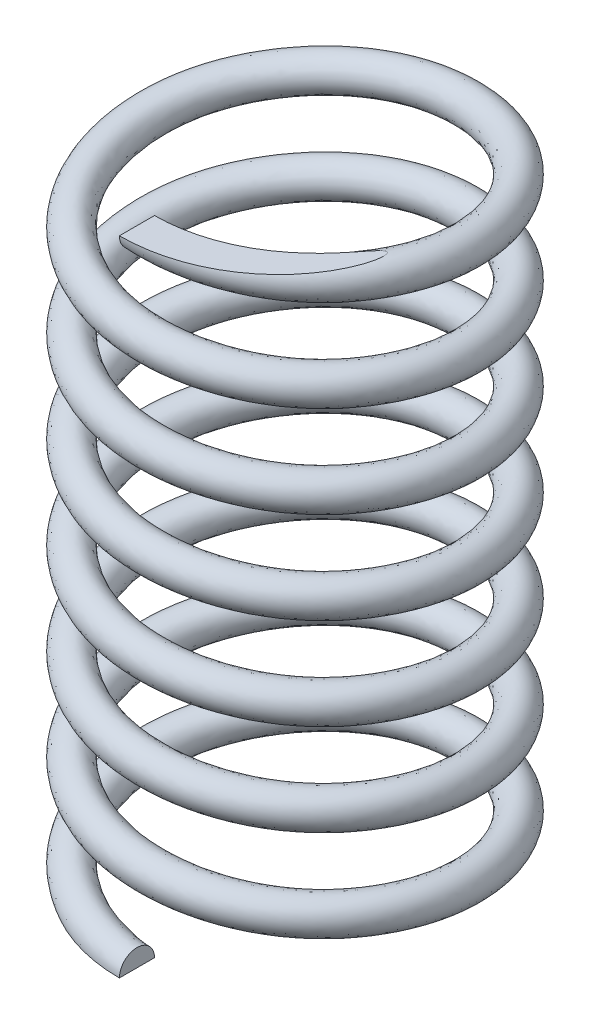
ISO-10303-21;
HEADER;
FILE_DESCRIPTION(('STEP AP214'),'2;1');
FILE_NAME('part.step','',(''),(''),'','','');
FILE_SCHEMA(('AUTOMOTIVE_DESIGN { 1 0 10303 214 1 1 1 1 }'));
ENDSEC;
DATA;
#1=APPLICATION_CONTEXT('core data for automotive mechanical design processes');
#2=APPLICATION_PROTOCOL_DEFINITION('international standard','automotive_design',2000,#1);
#3=PRODUCT_CONTEXT('',#1,'mechanical');
#4=PRODUCT('Part','Part','',(#3));
#5=PRODUCT_RELATED_PRODUCT_CATEGORY('part','',(#4));
#6=PRODUCT_DEFINITION_FORMATION('','',#4);
#7=PRODUCT_DEFINITION_CONTEXT('part definition',#1,'design');
#8=PRODUCT_DEFINITION('design','',#6,#7);
#9=PRODUCT_DEFINITION_SHAPE('','',#8);
#10=(LENGTH_UNIT() NAMED_UNIT(*) SI_UNIT(.MILLI.,.METRE.));
#11=(NAMED_UNIT(*) PLANE_ANGLE_UNIT() SI_UNIT($,.RADIAN.));
#12=(NAMED_UNIT(*) SI_UNIT($,.STERADIAN.) SOLID_ANGLE_UNIT());
#13=UNCERTAINTY_MEASURE_WITH_UNIT(LENGTH_MEASURE(1.E-05),#10,'distance_accuracy_value','');
#14=(GEOMETRIC_REPRESENTATION_CONTEXT(3) GLOBAL_UNCERTAINTY_ASSIGNED_CONTEXT((#13)) GLOBAL_UNIT_ASSIGNED_CONTEXT((#10,
#11,#12)) REPRESENTATION_CONTEXT('',''));
#15=CARTESIAN_POINT('',(0.,0.,0.));
#16=DIRECTION('',(0.,0.,1.));
#17=DIRECTION('',(1.,0.,0.));
#18=AXIS2_PLACEMENT_3D('',#15,#16,#17);
#19=CARTESIAN_POINT('',(0.,0.,5.715));
#20=DIRECTION('',(1.,0.,0.));
#21=DIRECTION('',(0.,0.,-1.));
#22=AXIS2_PLACEMENT_3D('',#19,#20,#21);
#23=PLANE('',#22);
#24=CARTESIAN_POINT('',(0.,0.,5.715));
#25=DIRECTION('',(1.,0.,0.));
#26=DIRECTION('',(0.,0.,-1.));
#27=AXIS2_PLACEMENT_3D('',#24,#25,#26);
#28=CIRCLE('',#27,0.635000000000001);
#29=CARTESIAN_POINT('',(0.,0.,5.08));
#30=VERTEX_POINT('',#29);
#31=CARTESIAN_POINT('',(0.,0.,6.35));
#32=VERTEX_POINT('',#31);
#33=EDGE_CURVE('E66',#30,#32,#28,.T.);
#34=ORIENTED_EDGE('',*,*,#33,.T.);
#35=DIRECTION('',(0.,0.,-1.));
#36=VECTOR('',#35,1.);
#37=CARTESIAN_POINT('',(0.,0.,5.715));
#38=LINE('',#37,#36);
#39=EDGE_CURVE('E49',#32,#30,#38,.T.);
#40=ORIENTED_EDGE('',*,*,#39,.T.);
#41=EDGE_LOOP('',(#34,#40));
#42=FACE_BOUND('',#41,.T.);
#43=ADVANCED_FACE('F31',(#42),#23,.T.);
#44=CARTESIAN_POINT('',(-5.58706843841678E-13,23.241,5.715));
#45=DIRECTION('',(1.,0.,0.));
#46=DIRECTION('',(0.,0.,-1.));
#47=AXIS2_PLACEMENT_3D('',#44,#45,#46);
#48=PLANE('',#47);
#49=DIRECTION('',(0.,0.,1.));
#50=VECTOR('',#49,1.);
#51=CARTESIAN_POINT('',(-5.58706843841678E-13,23.241,5.715));
#52=LINE('',#51,#50);
#53=CARTESIAN_POINT('',(0.,23.241,5.08));
#54=VERTEX_POINT('',#53);
#55=CARTESIAN_POINT('',(-6.20785382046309E-13,23.241,6.35));
#56=VERTEX_POINT('',#55);
#57=EDGE_CURVE('E55',#54,#56,#52,.T.);
#58=ORIENTED_EDGE('',*,*,#57,.F.);
#59=CARTESIAN_POINT('',(-5.58706843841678E-13,23.241,5.715));
#60=DIRECTION('',(1.,0.,0.));
#61=DIRECTION('',(0.,0.,-1.));
#62=AXIS2_PLACEMENT_3D('',#59,#60,#61);
#63=CIRCLE('',#62,0.635000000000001);
#64=EDGE_CURVE('E64',#56,#54,#63,.T.);
#65=ORIENTED_EDGE('',*,*,#64,.F.);
#66=EDGE_LOOP('',(#58,#65));
#67=FACE_BOUND('',#66,.T.);
#68=ADVANCED_FACE('F89',(#67),#48,.F.);
#69=CARTESIAN_POINT('',(0.,0.,5.08));
#70=CARTESIAN_POINT('',(-2.9329393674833,0.276678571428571,5.08));
#71=CARTESIAN_POINT('',(-4.39940905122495,0.553357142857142,2.54));
#72=CARTESIAN_POINT('',(-5.8658787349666,0.830035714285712,0.));
#73=CARTESIAN_POINT('',(-4.39940905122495,1.10671428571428,-2.54));
#74=CARTESIAN_POINT('',(-2.9329393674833,1.38339285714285,-5.08));
#75=CARTESIAN_POINT('',(0.,1.66007142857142,-5.08));
#76=CARTESIAN_POINT('',(2.9329393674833,1.93675,-5.08));
#77=CARTESIAN_POINT('',(4.39940905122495,2.21342857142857,-2.54));
#78=CARTESIAN_POINT('',(5.8658787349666,2.49010714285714,0.));
#79=CARTESIAN_POINT('',(4.39940905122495,2.76678571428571,2.54));
#80=CARTESIAN_POINT('',(2.9329393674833,3.04346428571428,5.08));
#81=CARTESIAN_POINT('',(0.,3.32014285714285,5.08));
#82=CARTESIAN_POINT('',(-2.9329393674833,3.59682142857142,5.08));
#83=CARTESIAN_POINT('',(-4.39940905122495,3.87349999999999,2.54));
#84=CARTESIAN_POINT('',(-5.8658787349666,4.15017857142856,0.));
#85=CARTESIAN_POINT('',(-4.39940905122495,4.42685714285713,-2.54));
#86=CARTESIAN_POINT('',(-2.9329393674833,4.7035357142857,-5.08));
#87=CARTESIAN_POINT('',(0.,4.98021428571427,-5.08));
#88=CARTESIAN_POINT('',(2.9329393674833,5.25689285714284,-5.08));
#89=CARTESIAN_POINT('',(4.39940905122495,5.53357142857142,-2.54));
#90=CARTESIAN_POINT('',(5.8658787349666,5.81024999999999,0.));
#91=CARTESIAN_POINT('',(4.39940905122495,6.08692857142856,2.54));
#92=CARTESIAN_POINT('',(2.9329393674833,6.36360714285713,5.08));
#93=CARTESIAN_POINT('',(0.,6.6402857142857,5.08));
#94=CARTESIAN_POINT('',(-2.9329393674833,6.91696428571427,5.08));
#95=CARTESIAN_POINT('',(-4.39940905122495,7.19364285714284,2.54));
#96=CARTESIAN_POINT('',(-5.8658787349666,7.47032142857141,0.));
#97=CARTESIAN_POINT('',(-4.39940905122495,7.74699999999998,-2.54));
#98=CARTESIAN_POINT('',(-2.9329393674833,8.02367857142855,-5.08));
#99=CARTESIAN_POINT('',(0.,8.30035714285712,-5.08));
#100=CARTESIAN_POINT('',(2.9329393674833,8.5770357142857,-5.08));
#101=CARTESIAN_POINT('',(4.39940905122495,8.85371428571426,-2.54));
#102=CARTESIAN_POINT('',(5.8658787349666,9.13039285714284,0.));
#103=CARTESIAN_POINT('',(4.39940905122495,9.40707142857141,2.54));
#104=CARTESIAN_POINT('',(2.9329393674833,9.68374999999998,5.08));
#105=CARTESIAN_POINT('',(0.,9.96042857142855,5.08));
#106=CARTESIAN_POINT('',(-2.9329393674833,10.2371071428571,5.08));
#107=CARTESIAN_POINT('',(-4.39940905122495,10.5137857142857,2.54));
#108=CARTESIAN_POINT('',(-5.8658787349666,10.7904642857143,0.));
#109=CARTESIAN_POINT('',(-4.39940905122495,11.0671428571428,-2.54));
#110=CARTESIAN_POINT('',(-2.9329393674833,11.3438214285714,-5.08));
#111=CARTESIAN_POINT('',(0.,11.6205,-5.08));
#112=CARTESIAN_POINT('',(2.9329393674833,11.8971785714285,-5.08));
#113=CARTESIAN_POINT('',(4.39940905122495,12.1738571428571,-2.54));
#114=CARTESIAN_POINT('',(5.8658787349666,12.4505357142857,0.));
#115=CARTESIAN_POINT('',(4.39940905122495,12.7272142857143,2.54));
#116=CARTESIAN_POINT('',(2.9329393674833,13.0038928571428,5.08));
#117=CARTESIAN_POINT('',(0.,13.2805714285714,5.08));
#118=CARTESIAN_POINT('',(-2.9329393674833,13.55725,5.08));
#119=CARTESIAN_POINT('',(-4.39940905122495,13.8339285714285,2.54));
#120=CARTESIAN_POINT('',(-5.8658787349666,14.1106071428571,0.));
#121=CARTESIAN_POINT('',(-4.39940905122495,14.3872857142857,-2.54));
#122=CARTESIAN_POINT('',(-2.9329393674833,14.6639642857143,-5.08));
#123=CARTESIAN_POINT('',(0.,14.9406428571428,-5.08));
#124=CARTESIAN_POINT('',(2.9329393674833,15.2173214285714,-5.08));
#125=CARTESIAN_POINT('',(4.39940905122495,15.494,-2.54));
#126=CARTESIAN_POINT('',(5.8658787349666,15.7706785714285,0.));
#127=CARTESIAN_POINT('',(4.39940905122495,16.0473571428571,2.54));
#128=CARTESIAN_POINT('',(2.9329393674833,16.3240357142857,5.08));
#129=CARTESIAN_POINT('',(0.,16.6007142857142,5.08));
#130=CARTESIAN_POINT('',(-2.9329393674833,16.8773928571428,5.08));
#131=CARTESIAN_POINT('',(-4.39940905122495,17.1540714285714,2.54));
#132=CARTESIAN_POINT('',(-5.8658787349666,17.43075,0.));
#133=CARTESIAN_POINT('',(-4.39940905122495,17.7074285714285,-2.54));
#134=CARTESIAN_POINT('',(-2.9329393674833,17.9841071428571,-5.08));
#135=CARTESIAN_POINT('',(0.,18.2607857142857,-5.08));
#136=CARTESIAN_POINT('',(2.9329393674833,18.5374642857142,-5.08));
#137=CARTESIAN_POINT('',(4.39940905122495,18.8141428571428,-2.54));
#138=CARTESIAN_POINT('',(5.8658787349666,19.0908214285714,0.));
#139=CARTESIAN_POINT('',(4.39940905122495,19.3675,2.54));
#140=CARTESIAN_POINT('',(2.9329393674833,19.6441785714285,5.08));
#141=CARTESIAN_POINT('',(0.,19.9208571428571,5.08));
#142=CARTESIAN_POINT('',(-2.9329393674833,20.1975357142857,5.08));
#143=CARTESIAN_POINT('',(-4.39940905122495,20.4742142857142,2.54));
#144=CARTESIAN_POINT('',(-5.8658787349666,20.7508928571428,0.));
#145=CARTESIAN_POINT('',(-4.39940905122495,21.0275714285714,-2.54));
#146=CARTESIAN_POINT('',(-2.9329393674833,21.3042499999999,-5.08));
#147=CARTESIAN_POINT('',(0.,21.5809285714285,-5.08));
#148=CARTESIAN_POINT('',(2.9329393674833,21.8576071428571,-5.08));
#149=CARTESIAN_POINT('',(4.39940905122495,22.1342857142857,-2.54));
#150=CARTESIAN_POINT('',(5.8658787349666,22.4109642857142,0.));
#151=CARTESIAN_POINT('',(4.39940905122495,22.6876428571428,2.54));
#152=CARTESIAN_POINT('',(2.9329393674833,22.9643214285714,5.08));
#153=CARTESIAN_POINT('',(0.,23.2409999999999,5.08));
#154=CARTESIAN_POINT('',(0.,1.27,5.08));
#155=CARTESIAN_POINT('',(-2.9329393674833,1.54667857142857,5.08));
#156=CARTESIAN_POINT('',(-4.39940905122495,1.82335714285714,2.54));
#157=CARTESIAN_POINT('',(-5.8658787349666,2.10003571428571,0.));
#158=CARTESIAN_POINT('',(-4.39940905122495,2.37671428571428,-2.54));
#159=CARTESIAN_POINT('',(-2.9329393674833,2.65339285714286,-5.08));
#160=CARTESIAN_POINT('',(0.,2.93007142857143,-5.08));
#161=CARTESIAN_POINT('',(2.9329393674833,3.20675,-5.08));
#162=CARTESIAN_POINT('',(4.39940905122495,3.48342857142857,-2.54));
#163=CARTESIAN_POINT('',(5.8658787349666,3.76010714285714,0.));
#164=CARTESIAN_POINT('',(4.39940905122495,4.03678571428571,2.54));
#165=CARTESIAN_POINT('',(2.9329393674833,4.31346428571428,5.08));
#166=CARTESIAN_POINT('',(0.,4.59014285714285,5.08));
#167=CARTESIAN_POINT('',(-2.9329393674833,4.86682142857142,5.08));
#168=CARTESIAN_POINT('',(-4.39940905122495,5.14349999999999,2.54));
#169=CARTESIAN_POINT('',(-5.8658787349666,5.42017857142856,0.));
#170=CARTESIAN_POINT('',(-4.39940905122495,5.69685714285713,-2.54));
#171=CARTESIAN_POINT('',(-2.9329393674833,5.97353571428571,-5.08));
#172=CARTESIAN_POINT('',(0.,6.25021428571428,-5.08));
#173=CARTESIAN_POINT('',(2.9329393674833,6.52689285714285,-5.08));
#174=CARTESIAN_POINT('',(4.39940905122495,6.80357142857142,-2.54));
#175=CARTESIAN_POINT('',(5.8658787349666,7.08024999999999,0.));
#176=CARTESIAN_POINT('',(4.39940905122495,7.35692857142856,2.54));
#177=CARTESIAN_POINT('',(2.9329393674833,7.63360714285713,5.08));
#178=CARTESIAN_POINT('',(0.,7.9102857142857,5.08));
#179=CARTESIAN_POINT('',(-2.9329393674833,8.18696428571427,5.08));
#180=CARTESIAN_POINT('',(-4.39940905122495,8.46364285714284,2.54));
#181=CARTESIAN_POINT('',(-5.8658787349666,8.74032142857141,0.));
#182=CARTESIAN_POINT('',(-4.39940905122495,9.01699999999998,-2.54));
#183=CARTESIAN_POINT('',(-2.9329393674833,9.29367857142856,-5.08));
#184=CARTESIAN_POINT('',(0.,9.57035714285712,-5.08));
#185=CARTESIAN_POINT('',(2.9329393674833,9.8470357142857,-5.08));
#186=CARTESIAN_POINT('',(4.39940905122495,10.1237142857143,-2.54));
#187=CARTESIAN_POINT('',(5.8658787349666,10.4003928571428,0.));
#188=CARTESIAN_POINT('',(4.39940905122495,10.6770714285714,2.54));
#189=CARTESIAN_POINT('',(2.9329393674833,10.95375,5.08));
#190=CARTESIAN_POINT('',(0.,11.2304285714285,5.08));
#191=CARTESIAN_POINT('',(-2.9329393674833,11.5071071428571,5.08));
#192=CARTESIAN_POINT('',(-4.39940905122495,11.7837857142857,2.54));
#193=CARTESIAN_POINT('',(-5.8658787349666,12.0604642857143,0.));
#194=CARTESIAN_POINT('',(-4.39940905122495,12.3371428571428,-2.54));
#195=CARTESIAN_POINT('',(-2.9329393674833,12.6138214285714,-5.08));
#196=CARTESIAN_POINT('',(0.,12.8905,-5.08));
#197=CARTESIAN_POINT('',(2.9329393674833,13.1671785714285,-5.08));
#198=CARTESIAN_POINT('',(4.39940905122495,13.4438571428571,-2.54));
#199=CARTESIAN_POINT('',(5.8658787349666,13.7205357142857,0.));
#200=CARTESIAN_POINT('',(4.39940905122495,13.9972142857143,2.54));
#201=CARTESIAN_POINT('',(2.9329393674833,14.2738928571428,5.08));
#202=CARTESIAN_POINT('',(0.,14.5505714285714,5.08));
#203=CARTESIAN_POINT('',(-2.9329393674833,14.82725,5.08));
#204=CARTESIAN_POINT('',(-4.39940905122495,15.1039285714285,2.54));
#205=CARTESIAN_POINT('',(-5.8658787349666,15.3806071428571,0.));
#206=CARTESIAN_POINT('',(-4.39940905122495,15.6572857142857,-2.54));
#207=CARTESIAN_POINT('',(-2.9329393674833,15.9339642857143,-5.08));
#208=CARTESIAN_POINT('',(0.,16.2106428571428,-5.08));
#209=CARTESIAN_POINT('',(2.9329393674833,16.4873214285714,-5.08));
#210=CARTESIAN_POINT('',(4.39940905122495,16.764,-2.54));
#211=CARTESIAN_POINT('',(5.8658787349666,17.0406785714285,0.));
#212=CARTESIAN_POINT('',(4.39940905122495,17.3173571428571,2.54));
#213=CARTESIAN_POINT('',(2.9329393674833,17.5940357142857,5.08));
#214=CARTESIAN_POINT('',(0.,17.8707142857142,5.08));
#215=CARTESIAN_POINT('',(-2.9329393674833,18.1473928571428,5.08));
#216=CARTESIAN_POINT('',(-4.39940905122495,18.4240714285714,2.54));
#217=CARTESIAN_POINT('',(-5.8658787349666,18.70075,0.));
#218=CARTESIAN_POINT('',(-4.39940905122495,18.9774285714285,-2.54));
#219=CARTESIAN_POINT('',(-2.9329393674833,19.2541071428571,-5.08));
#220=CARTESIAN_POINT('',(0.,19.5307857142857,-5.08));
#221=CARTESIAN_POINT('',(2.9329393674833,19.8074642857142,-5.08));
#222=CARTESIAN_POINT('',(4.39940905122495,20.0841428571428,-2.54));
#223=CARTESIAN_POINT('',(5.8658787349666,20.3608214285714,0.));
#224=CARTESIAN_POINT('',(4.39940905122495,20.6375,2.54));
#225=CARTESIAN_POINT('',(2.9329393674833,20.9141785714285,5.08));
#226=CARTESIAN_POINT('',(0.,21.1908571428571,5.08));
#227=CARTESIAN_POINT('',(-2.9329393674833,21.4675357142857,5.08));
#228=CARTESIAN_POINT('',(-4.39940905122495,21.7442142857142,2.54));
#229=CARTESIAN_POINT('',(-5.8658787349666,22.0208928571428,0.));
#230=CARTESIAN_POINT('',(-4.39940905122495,22.2975714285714,-2.54));
#231=CARTESIAN_POINT('',(-2.9329393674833,22.57425,-5.08));
#232=CARTESIAN_POINT('',(0.,22.8509285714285,-5.08));
#233=CARTESIAN_POINT('',(2.9329393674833,23.1276071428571,-5.08));
#234=CARTESIAN_POINT('',(4.39940905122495,23.4042857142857,-2.54));
#235=CARTESIAN_POINT('',(5.8658787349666,23.6809642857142,0.));
#236=CARTESIAN_POINT('',(4.39940905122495,23.9576428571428,2.54));
#237=CARTESIAN_POINT('',(2.9329393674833,24.2343214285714,5.08));
#238=CARTESIAN_POINT('',(0.,24.5109999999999,5.08));
#239=CARTESIAN_POINT('',(0.,1.27,6.35));
#240=CARTESIAN_POINT('',(-3.66617420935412,1.54667857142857,6.35));
#241=CARTESIAN_POINT('',(-5.49926131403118,1.82335714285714,3.175));
#242=CARTESIAN_POINT('',(-7.33234841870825,2.10003571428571,0.));
#243=CARTESIAN_POINT('',(-5.49926131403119,2.37671428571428,-3.175));
#244=CARTESIAN_POINT('',(-3.66617420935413,2.65339285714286,-6.35));
#245=CARTESIAN_POINT('',(0.,2.93007142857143,-6.35));
#246=CARTESIAN_POINT('',(3.66617420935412,3.20675,-6.35));
#247=CARTESIAN_POINT('',(5.49926131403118,3.48342857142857,-3.175));
#248=CARTESIAN_POINT('',(7.33234841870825,3.76010714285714,0.));
#249=CARTESIAN_POINT('',(5.49926131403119,4.03678571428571,3.175));
#250=CARTESIAN_POINT('',(3.66617420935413,4.31346428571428,6.35));
#251=CARTESIAN_POINT('',(0.,4.59014285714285,6.35));
#252=CARTESIAN_POINT('',(-3.66617420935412,4.86682142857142,6.35));
#253=CARTESIAN_POINT('',(-5.49926131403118,5.14349999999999,3.175));
#254=CARTESIAN_POINT('',(-7.33234841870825,5.42017857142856,0.));
#255=CARTESIAN_POINT('',(-5.49926131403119,5.69685714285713,-3.175));
#256=CARTESIAN_POINT('',(-3.66617420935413,5.97353571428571,-6.35));
#257=CARTESIAN_POINT('',(0.,6.25021428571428,-6.35));
#258=CARTESIAN_POINT('',(3.66617420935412,6.52689285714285,-6.35));
#259=CARTESIAN_POINT('',(5.49926131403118,6.80357142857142,-3.175));
#260=CARTESIAN_POINT('',(7.33234841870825,7.08024999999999,0.));
#261=CARTESIAN_POINT('',(5.49926131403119,7.35692857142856,3.175));
#262=CARTESIAN_POINT('',(3.66617420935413,7.63360714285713,6.35));
#263=CARTESIAN_POINT('',(0.,7.9102857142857,6.35));
#264=CARTESIAN_POINT('',(-3.66617420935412,8.18696428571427,6.35));
#265=CARTESIAN_POINT('',(-5.49926131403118,8.46364285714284,3.175));
#266=CARTESIAN_POINT('',(-7.33234841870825,8.74032142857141,0.));
#267=CARTESIAN_POINT('',(-5.49926131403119,9.01699999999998,-3.175));
#268=CARTESIAN_POINT('',(-3.66617420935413,9.29367857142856,-6.35));
#269=CARTESIAN_POINT('',(0.,9.57035714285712,-6.35));
#270=CARTESIAN_POINT('',(3.66617420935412,9.8470357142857,-6.35));
#271=CARTESIAN_POINT('',(5.49926131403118,10.1237142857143,-3.175));
#272=CARTESIAN_POINT('',(7.33234841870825,10.4003928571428,0.));
#273=CARTESIAN_POINT('',(5.49926131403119,10.6770714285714,3.175));
#274=CARTESIAN_POINT('',(3.66617420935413,10.95375,6.35));
#275=CARTESIAN_POINT('',(0.,11.2304285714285,6.35));
#276=CARTESIAN_POINT('',(-3.66617420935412,11.5071071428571,6.35));
#277=CARTESIAN_POINT('',(-5.49926131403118,11.7837857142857,3.175));
#278=CARTESIAN_POINT('',(-7.33234841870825,12.0604642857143,0.));
#279=CARTESIAN_POINT('',(-5.49926131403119,12.3371428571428,-3.175));
#280=CARTESIAN_POINT('',(-3.66617420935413,12.6138214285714,-6.35));
#281=CARTESIAN_POINT('',(0.,12.8905,-6.35));
#282=CARTESIAN_POINT('',(3.66617420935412,13.1671785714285,-6.35));
#283=CARTESIAN_POINT('',(5.49926131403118,13.4438571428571,-3.175));
#284=CARTESIAN_POINT('',(7.33234841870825,13.7205357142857,0.));
#285=CARTESIAN_POINT('',(5.49926131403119,13.9972142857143,3.175));
#286=CARTESIAN_POINT('',(3.66617420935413,14.2738928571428,6.35));
#287=CARTESIAN_POINT('',(0.,14.5505714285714,6.35));
#288=CARTESIAN_POINT('',(-3.66617420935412,14.82725,6.35));
#289=CARTESIAN_POINT('',(-5.49926131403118,15.1039285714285,3.175));
#290=CARTESIAN_POINT('',(-7.33234841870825,15.3806071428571,0.));
#291=CARTESIAN_POINT('',(-5.49926131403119,15.6572857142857,-3.175));
#292=CARTESIAN_POINT('',(-3.66617420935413,15.9339642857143,-6.35));
#293=CARTESIAN_POINT('',(0.,16.2106428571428,-6.35));
#294=CARTESIAN_POINT('',(3.66617420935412,16.4873214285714,-6.35));
#295=CARTESIAN_POINT('',(5.49926131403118,16.764,-3.175));
#296=CARTESIAN_POINT('',(7.33234841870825,17.0406785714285,0.));
#297=CARTESIAN_POINT('',(5.49926131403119,17.3173571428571,3.175));
#298=CARTESIAN_POINT('',(3.66617420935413,17.5940357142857,6.35));
#299=CARTESIAN_POINT('',(0.,17.8707142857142,6.35));
#300=CARTESIAN_POINT('',(-3.66617420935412,18.1473928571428,6.35));
#301=CARTESIAN_POINT('',(-5.49926131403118,18.4240714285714,3.175));
#302=CARTESIAN_POINT('',(-7.33234841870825,18.70075,0.));
#303=CARTESIAN_POINT('',(-5.49926131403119,18.9774285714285,-3.175));
#304=CARTESIAN_POINT('',(-3.66617420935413,19.2541071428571,-6.35));
#305=CARTESIAN_POINT('',(0.,19.5307857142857,-6.35));
#306=CARTESIAN_POINT('',(3.66617420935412,19.8074642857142,-6.35));
#307=CARTESIAN_POINT('',(5.49926131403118,20.0841428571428,-3.175));
#308=CARTESIAN_POINT('',(7.33234841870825,20.3608214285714,0.));
#309=CARTESIAN_POINT('',(5.49926131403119,20.6375,3.175));
#310=CARTESIAN_POINT('',(3.66617420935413,20.9141785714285,6.35));
#311=CARTESIAN_POINT('',(0.,21.1908571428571,6.35));
#312=CARTESIAN_POINT('',(-3.66617420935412,21.4675357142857,6.35));
#313=CARTESIAN_POINT('',(-5.49926131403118,21.7442142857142,3.175));
#314=CARTESIAN_POINT('',(-7.33234841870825,22.0208928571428,0.));
#315=CARTESIAN_POINT('',(-5.49926131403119,22.2975714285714,-3.175));
#316=CARTESIAN_POINT('',(-3.66617420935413,22.57425,-6.35));
#317=CARTESIAN_POINT('',(0.,22.8509285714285,-6.35));
#318=CARTESIAN_POINT('',(3.66617420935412,23.1276071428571,-6.35));
#319=CARTESIAN_POINT('',(5.49926131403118,23.4042857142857,-3.175));
#320=CARTESIAN_POINT('',(7.33234841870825,23.6809642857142,0.));
#321=CARTESIAN_POINT('',(5.49926131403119,23.9576428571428,3.175));
#322=CARTESIAN_POINT('',(3.66617420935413,24.2343214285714,6.35));
#323=CARTESIAN_POINT('',(0.,24.5109999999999,6.35));
#324=CARTESIAN_POINT('',(0.,0.,6.35));
#325=CARTESIAN_POINT('',(-3.66617420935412,0.276678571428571,6.35));
#326=CARTESIAN_POINT('',(-5.49926131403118,0.553357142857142,3.175));
#327=CARTESIAN_POINT('',(-7.33234841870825,0.830035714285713,0.));
#328=CARTESIAN_POINT('',(-5.49926131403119,1.10671428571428,-3.175));
#329=CARTESIAN_POINT('',(-3.66617420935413,1.38339285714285,-6.35));
#330=CARTESIAN_POINT('',(0.,1.66007142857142,-6.35));
#331=CARTESIAN_POINT('',(3.66617420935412,1.93675,-6.35));
#332=CARTESIAN_POINT('',(5.49926131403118,2.21342857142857,-3.175));
#333=CARTESIAN_POINT('',(7.33234841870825,2.49010714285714,0.));
#334=CARTESIAN_POINT('',(5.49926131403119,2.76678571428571,3.175));
#335=CARTESIAN_POINT('',(3.66617420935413,3.04346428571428,6.35));
#336=CARTESIAN_POINT('',(0.,3.32014285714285,6.35));
#337=CARTESIAN_POINT('',(-3.66617420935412,3.59682142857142,6.35));
#338=CARTESIAN_POINT('',(-5.49926131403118,3.87349999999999,3.175));
#339=CARTESIAN_POINT('',(-7.33234841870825,4.15017857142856,0.));
#340=CARTESIAN_POINT('',(-5.49926131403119,4.42685714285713,-3.175));
#341=CARTESIAN_POINT('',(-3.66617420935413,4.7035357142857,-6.35));
#342=CARTESIAN_POINT('',(0.,4.98021428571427,-6.35));
#343=CARTESIAN_POINT('',(3.66617420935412,5.25689285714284,-6.35));
#344=CARTESIAN_POINT('',(5.49926131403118,5.53357142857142,-3.175));
#345=CARTESIAN_POINT('',(7.33234841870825,5.81024999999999,0.));
#346=CARTESIAN_POINT('',(5.49926131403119,6.08692857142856,3.175));
#347=CARTESIAN_POINT('',(3.66617420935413,6.36360714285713,6.35));
#348=CARTESIAN_POINT('',(0.,6.6402857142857,6.35));
#349=CARTESIAN_POINT('',(-3.66617420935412,6.91696428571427,6.35));
#350=CARTESIAN_POINT('',(-5.49926131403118,7.19364285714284,3.175));
#351=CARTESIAN_POINT('',(-7.33234841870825,7.47032142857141,0.));
#352=CARTESIAN_POINT('',(-5.49926131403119,7.74699999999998,-3.175));
#353=CARTESIAN_POINT('',(-3.66617420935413,8.02367857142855,-6.35));
#354=CARTESIAN_POINT('',(0.,8.30035714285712,-6.35));
#355=CARTESIAN_POINT('',(3.66617420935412,8.5770357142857,-6.35));
#356=CARTESIAN_POINT('',(5.49926131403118,8.85371428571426,-3.175));
#357=CARTESIAN_POINT('',(7.33234841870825,9.13039285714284,0.));
#358=CARTESIAN_POINT('',(5.49926131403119,9.40707142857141,3.175));
#359=CARTESIAN_POINT('',(3.66617420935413,9.68374999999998,6.35));
#360=CARTESIAN_POINT('',(0.,9.96042857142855,6.35));
#361=CARTESIAN_POINT('',(-3.66617420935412,10.2371071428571,6.35));
#362=CARTESIAN_POINT('',(-5.49926131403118,10.5137857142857,3.175));
#363=CARTESIAN_POINT('',(-7.33234841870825,10.7904642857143,0.));
#364=CARTESIAN_POINT('',(-5.49926131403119,11.0671428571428,-3.175));
#365=CARTESIAN_POINT('',(-3.66617420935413,11.3438214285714,-6.35));
#366=CARTESIAN_POINT('',(0.,11.6205,-6.35));
#367=CARTESIAN_POINT('',(3.66617420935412,11.8971785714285,-6.35));
#368=CARTESIAN_POINT('',(5.49926131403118,12.1738571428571,-3.175));
#369=CARTESIAN_POINT('',(7.33234841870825,12.4505357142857,0.));
#370=CARTESIAN_POINT('',(5.49926131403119,12.7272142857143,3.175));
#371=CARTESIAN_POINT('',(3.66617420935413,13.0038928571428,6.35));
#372=CARTESIAN_POINT('',(0.,13.2805714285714,6.35));
#373=CARTESIAN_POINT('',(-3.66617420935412,13.55725,6.35));
#374=CARTESIAN_POINT('',(-5.49926131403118,13.8339285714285,3.175));
#375=CARTESIAN_POINT('',(-7.33234841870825,14.1106071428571,0.));
#376=CARTESIAN_POINT('',(-5.49926131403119,14.3872857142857,-3.175));
#377=CARTESIAN_POINT('',(-3.66617420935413,14.6639642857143,-6.35));
#378=CARTESIAN_POINT('',(0.,14.9406428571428,-6.35));
#379=CARTESIAN_POINT('',(3.66617420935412,15.2173214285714,-6.35));
#380=CARTESIAN_POINT('',(5.49926131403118,15.494,-3.175));
#381=CARTESIAN_POINT('',(7.33234841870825,15.7706785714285,0.));
#382=CARTESIAN_POINT('',(5.49926131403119,16.0473571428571,3.175));
#383=CARTESIAN_POINT('',(3.66617420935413,16.3240357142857,6.35));
#384=CARTESIAN_POINT('',(0.,16.6007142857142,6.35));
#385=CARTESIAN_POINT('',(-3.66617420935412,16.8773928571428,6.35));
#386=CARTESIAN_POINT('',(-5.49926131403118,17.1540714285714,3.175));
#387=CARTESIAN_POINT('',(-7.33234841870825,17.43075,0.));
#388=CARTESIAN_POINT('',(-5.49926131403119,17.7074285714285,-3.175));
#389=CARTESIAN_POINT('',(-3.66617420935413,17.9841071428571,-6.35));
#390=CARTESIAN_POINT('',(0.,18.2607857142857,-6.35));
#391=CARTESIAN_POINT('',(3.66617420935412,18.5374642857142,-6.35));
#392=CARTESIAN_POINT('',(5.49926131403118,18.8141428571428,-3.175));
#393=CARTESIAN_POINT('',(7.33234841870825,19.0908214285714,0.));
#394=CARTESIAN_POINT('',(5.49926131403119,19.3675,3.175));
#395=CARTESIAN_POINT('',(3.66617420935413,19.6441785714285,6.35));
#396=CARTESIAN_POINT('',(0.,19.9208571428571,6.35));
#397=CARTESIAN_POINT('',(-3.66617420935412,20.1975357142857,6.35));
#398=CARTESIAN_POINT('',(-5.49926131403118,20.4742142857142,3.175));
#399=CARTESIAN_POINT('',(-7.33234841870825,20.7508928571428,0.));
#400=CARTESIAN_POINT('',(-5.49926131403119,21.0275714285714,-3.175));
#401=CARTESIAN_POINT('',(-3.66617420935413,21.3042499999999,-6.35));
#402=CARTESIAN_POINT('',(0.,21.5809285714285,-6.35));
#403=CARTESIAN_POINT('',(3.66617420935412,21.8576071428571,-6.35));
#404=CARTESIAN_POINT('',(5.49926131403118,22.1342857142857,-3.175));
#405=CARTESIAN_POINT('',(7.33234841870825,22.4109642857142,0.));
#406=CARTESIAN_POINT('',(5.49926131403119,22.6876428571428,3.175));
#407=CARTESIAN_POINT('',(3.66617420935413,22.9643214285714,6.35));
#408=CARTESIAN_POINT('',(0.,23.2409999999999,6.35));
#409=CARTESIAN_POINT('',(0.,-1.27,6.35));
#410=CARTESIAN_POINT('',(-3.66617420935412,-0.99332142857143,6.35));
#411=CARTESIAN_POINT('',(-5.49926131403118,-0.716642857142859,3.175));
#412=CARTESIAN_POINT('',(-7.33234841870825,-0.439964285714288,0.));
#413=CARTESIAN_POINT('',(-5.49926131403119,-0.163285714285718,-3.175));
#414=CARTESIAN_POINT('',(-3.66617420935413,0.113392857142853,-6.35));
#415=CARTESIAN_POINT('',(0.,0.390071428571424,-6.35));
#416=CARTESIAN_POINT('',(3.66617420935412,0.666749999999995,-6.35));
#417=CARTESIAN_POINT('',(5.49926131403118,0.943428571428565,-3.175));
#418=CARTESIAN_POINT('',(7.33234841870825,1.22010714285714,0.));
#419=CARTESIAN_POINT('',(5.49926131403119,1.49678571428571,3.175));
#420=CARTESIAN_POINT('',(3.66617420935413,1.77346428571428,6.35));
#421=CARTESIAN_POINT('',(0.,2.05014285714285,6.35));
#422=CARTESIAN_POINT('',(-3.66617420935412,2.32682142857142,6.35));
#423=CARTESIAN_POINT('',(-5.49926131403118,2.60349999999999,3.175));
#424=CARTESIAN_POINT('',(-7.33234841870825,2.88017857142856,0.));
#425=CARTESIAN_POINT('',(-5.49926131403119,3.15685714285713,-3.175));
#426=CARTESIAN_POINT('',(-3.66617420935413,3.4335357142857,-6.35));
#427=CARTESIAN_POINT('',(0.,3.71021428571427,-6.35));
#428=CARTESIAN_POINT('',(3.66617420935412,3.98689285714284,-6.35));
#429=CARTESIAN_POINT('',(5.49926131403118,4.26357142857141,-3.175));
#430=CARTESIAN_POINT('',(7.33234841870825,4.54024999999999,0.));
#431=CARTESIAN_POINT('',(5.49926131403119,4.81692857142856,3.175));
#432=CARTESIAN_POINT('',(3.66617420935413,5.09360714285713,6.35));
#433=CARTESIAN_POINT('',(0.,5.3702857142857,6.35));
#434=CARTESIAN_POINT('',(-3.66617420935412,5.64696428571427,6.35));
#435=CARTESIAN_POINT('',(-5.49926131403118,5.92364285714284,3.175));
#436=CARTESIAN_POINT('',(-7.33234841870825,6.20032142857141,0.));
#437=CARTESIAN_POINT('',(-5.49926131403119,6.47699999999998,-3.175));
#438=CARTESIAN_POINT('',(-3.66617420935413,6.75367857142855,-6.35));
#439=CARTESIAN_POINT('',(0.,7.03035714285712,-6.35));
#440=CARTESIAN_POINT('',(3.66617420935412,7.30703571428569,-6.35));
#441=CARTESIAN_POINT('',(5.49926131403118,7.58371428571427,-3.175));
#442=CARTESIAN_POINT('',(7.33234841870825,7.86039285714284,0.));
#443=CARTESIAN_POINT('',(5.49926131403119,8.13707142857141,3.175));
#444=CARTESIAN_POINT('',(3.66617420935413,8.41374999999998,6.35));
#445=CARTESIAN_POINT('',(0.,8.69042857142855,6.35));
#446=CARTESIAN_POINT('',(-3.66617420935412,8.96710714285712,6.35));
#447=CARTESIAN_POINT('',(-5.49926131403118,9.24378571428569,3.175));
#448=CARTESIAN_POINT('',(-7.33234841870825,9.52046428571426,0.));
#449=CARTESIAN_POINT('',(-5.49926131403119,9.79714285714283,-3.175));
#450=CARTESIAN_POINT('',(-3.66617420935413,10.0738214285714,-6.35));
#451=CARTESIAN_POINT('',(0.,10.3505,-6.35));
#452=CARTESIAN_POINT('',(3.66617420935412,10.6271785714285,-6.35));
#453=CARTESIAN_POINT('',(5.49926131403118,10.9038571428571,-3.175));
#454=CARTESIAN_POINT('',(7.33234841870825,11.1805357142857,0.));
#455=CARTESIAN_POINT('',(5.49926131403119,11.4572142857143,3.175));
#456=CARTESIAN_POINT('',(3.66617420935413,11.7338928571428,6.35));
#457=CARTESIAN_POINT('',(0.,12.0105714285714,6.35));
#458=CARTESIAN_POINT('',(-3.66617420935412,12.28725,6.35));
#459=CARTESIAN_POINT('',(-5.49926131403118,12.5639285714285,3.175));
#460=CARTESIAN_POINT('',(-7.33234841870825,12.8406071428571,0.));
#461=CARTESIAN_POINT('',(-5.49926131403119,13.1172857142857,-3.175));
#462=CARTESIAN_POINT('',(-3.66617420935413,13.3939642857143,-6.35));
#463=CARTESIAN_POINT('',(0.,13.6706428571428,-6.35));
#464=CARTESIAN_POINT('',(3.66617420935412,13.9473214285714,-6.35));
#465=CARTESIAN_POINT('',(5.49926131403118,14.224,-3.175));
#466=CARTESIAN_POINT('',(7.33234841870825,14.5006785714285,0.));
#467=CARTESIAN_POINT('',(5.49926131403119,14.7773571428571,3.175));
#468=CARTESIAN_POINT('',(3.66617420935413,15.0540357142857,6.35));
#469=CARTESIAN_POINT('',(0.,15.3307142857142,6.35));
#470=CARTESIAN_POINT('',(-3.66617420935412,15.6073928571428,6.35));
#471=CARTESIAN_POINT('',(-5.49926131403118,15.8840714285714,3.175));
#472=CARTESIAN_POINT('',(-7.33234841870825,16.16075,0.));
#473=CARTESIAN_POINT('',(-5.49926131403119,16.4374285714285,-3.175));
#474=CARTESIAN_POINT('',(-3.66617420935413,16.7141071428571,-6.35));
#475=CARTESIAN_POINT('',(0.,16.9907857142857,-6.35));
#476=CARTESIAN_POINT('',(3.66617420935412,17.2674642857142,-6.35));
#477=CARTESIAN_POINT('',(5.49926131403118,17.5441428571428,-3.175));
#478=CARTESIAN_POINT('',(7.33234841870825,17.8208214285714,0.));
#479=CARTESIAN_POINT('',(5.49926131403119,18.0975,3.175));
#480=CARTESIAN_POINT('',(3.66617420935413,18.3741785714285,6.35));
#481=CARTESIAN_POINT('',(0.,18.6508571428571,6.35));
#482=CARTESIAN_POINT('',(-3.66617420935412,18.9275357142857,6.35));
#483=CARTESIAN_POINT('',(-5.49926131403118,19.2042142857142,3.175));
#484=CARTESIAN_POINT('',(-7.33234841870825,19.4808928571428,0.));
#485=CARTESIAN_POINT('',(-5.49926131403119,19.7575714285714,-3.175));
#486=CARTESIAN_POINT('',(-3.66617420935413,20.03425,-6.35));
#487=CARTESIAN_POINT('',(0.,20.3109285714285,-6.35));
#488=CARTESIAN_POINT('',(3.66617420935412,20.5876071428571,-6.35));
#489=CARTESIAN_POINT('',(5.49926131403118,20.8642857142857,-3.175));
#490=CARTESIAN_POINT('',(7.33234841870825,21.1409642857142,0.));
#491=CARTESIAN_POINT('',(5.49926131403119,21.4176428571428,3.175));
#492=CARTESIAN_POINT('',(3.66617420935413,21.6943214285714,6.35));
#493=CARTESIAN_POINT('',(0.,21.9709999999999,6.35));
#494=CARTESIAN_POINT('',(0.,-1.27,5.08));
#495=CARTESIAN_POINT('',(-2.9329393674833,-0.99332142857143,5.08));
#496=CARTESIAN_POINT('',(-4.39940905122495,-0.716642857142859,2.54));
#497=CARTESIAN_POINT('',(-5.8658787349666,-0.439964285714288,0.));
#498=CARTESIAN_POINT('',(-4.39940905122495,-0.163285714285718,-2.54));
#499=CARTESIAN_POINT('',(-2.9329393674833,0.113392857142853,-5.08));
#500=CARTESIAN_POINT('',(0.,0.390071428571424,-5.08));
#501=CARTESIAN_POINT('',(2.9329393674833,0.666749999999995,-5.08));
#502=CARTESIAN_POINT('',(4.39940905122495,0.943428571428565,-2.54));
#503=CARTESIAN_POINT('',(5.8658787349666,1.22010714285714,0.));
#504=CARTESIAN_POINT('',(4.39940905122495,1.49678571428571,2.54));
#505=CARTESIAN_POINT('',(2.9329393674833,1.77346428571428,5.08));
#506=CARTESIAN_POINT('',(0.,2.05014285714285,5.08));
#507=CARTESIAN_POINT('',(-2.9329393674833,2.32682142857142,5.08));
#508=CARTESIAN_POINT('',(-4.39940905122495,2.60349999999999,2.54));
#509=CARTESIAN_POINT('',(-5.8658787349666,2.88017857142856,0.));
#510=CARTESIAN_POINT('',(-4.39940905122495,3.15685714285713,-2.54));
#511=CARTESIAN_POINT('',(-2.9329393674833,3.4335357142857,-5.08));
#512=CARTESIAN_POINT('',(0.,3.71021428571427,-5.08));
#513=CARTESIAN_POINT('',(2.9329393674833,3.98689285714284,-5.08));
#514=CARTESIAN_POINT('',(4.39940905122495,4.26357142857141,-2.54));
#515=CARTESIAN_POINT('',(5.8658787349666,4.54024999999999,0.));
#516=CARTESIAN_POINT('',(4.39940905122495,4.81692857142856,2.54));
#517=CARTESIAN_POINT('',(2.9329393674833,5.09360714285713,5.08));
#518=CARTESIAN_POINT('',(0.,5.3702857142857,5.08));
#519=CARTESIAN_POINT('',(-2.9329393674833,5.64696428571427,5.08));
#520=CARTESIAN_POINT('',(-4.39940905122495,5.92364285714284,2.54));
#521=CARTESIAN_POINT('',(-5.8658787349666,6.20032142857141,0.));
#522=CARTESIAN_POINT('',(-4.39940905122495,6.47699999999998,-2.54));
#523=CARTESIAN_POINT('',(-2.9329393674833,6.75367857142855,-5.08));
#524=CARTESIAN_POINT('',(0.,7.03035714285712,-5.08));
#525=CARTESIAN_POINT('',(2.9329393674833,7.30703571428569,-5.08));
#526=CARTESIAN_POINT('',(4.39940905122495,7.58371428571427,-2.54));
#527=CARTESIAN_POINT('',(5.8658787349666,7.86039285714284,0.));
#528=CARTESIAN_POINT('',(4.39940905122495,8.13707142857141,2.54));
#529=CARTESIAN_POINT('',(2.9329393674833,8.41374999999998,5.08));
#530=CARTESIAN_POINT('',(0.,8.69042857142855,5.08));
#531=CARTESIAN_POINT('',(-2.9329393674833,8.96710714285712,5.08));
#532=CARTESIAN_POINT('',(-4.39940905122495,9.24378571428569,2.54));
#533=CARTESIAN_POINT('',(-5.8658787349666,9.52046428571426,0.));
#534=CARTESIAN_POINT('',(-4.39940905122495,9.79714285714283,-2.54));
#535=CARTESIAN_POINT('',(-2.9329393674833,10.0738214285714,-5.08));
#536=CARTESIAN_POINT('',(0.,10.3505,-5.08));
#537=CARTESIAN_POINT('',(2.9329393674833,10.6271785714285,-5.08));
#538=CARTESIAN_POINT('',(4.39940905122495,10.9038571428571,-2.54));
#539=CARTESIAN_POINT('',(5.8658787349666,11.1805357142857,0.));
#540=CARTESIAN_POINT('',(4.39940905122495,11.4572142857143,2.54));
#541=CARTESIAN_POINT('',(2.9329393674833,11.7338928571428,5.08));
#542=CARTESIAN_POINT('',(0.,12.0105714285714,5.08));
#543=CARTESIAN_POINT('',(-2.9329393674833,12.28725,5.08));
#544=CARTESIAN_POINT('',(-4.39940905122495,12.5639285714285,2.54));
#545=CARTESIAN_POINT('',(-5.8658787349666,12.8406071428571,0.));
#546=CARTESIAN_POINT('',(-4.39940905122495,13.1172857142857,-2.54));
#547=CARTESIAN_POINT('',(-2.9329393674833,13.3939642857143,-5.08));
#548=CARTESIAN_POINT('',(0.,13.6706428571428,-5.08));
#549=CARTESIAN_POINT('',(2.9329393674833,13.9473214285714,-5.08));
#550=CARTESIAN_POINT('',(4.39940905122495,14.224,-2.54));
#551=CARTESIAN_POINT('',(5.8658787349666,14.5006785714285,0.));
#552=CARTESIAN_POINT('',(4.39940905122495,14.7773571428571,2.54));
#553=CARTESIAN_POINT('',(2.9329393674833,15.0540357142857,5.08));
#554=CARTESIAN_POINT('',(0.,15.3307142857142,5.08));
#555=CARTESIAN_POINT('',(-2.9329393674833,15.6073928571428,5.08));
#556=CARTESIAN_POINT('',(-4.39940905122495,15.8840714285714,2.54));
#557=CARTESIAN_POINT('',(-5.8658787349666,16.16075,0.));
#558=CARTESIAN_POINT('',(-4.39940905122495,16.4374285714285,-2.54));
#559=CARTESIAN_POINT('',(-2.9329393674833,16.7141071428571,-5.08));
#560=CARTESIAN_POINT('',(0.,16.9907857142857,-5.08));
#561=CARTESIAN_POINT('',(2.9329393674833,17.2674642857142,-5.08));
#562=CARTESIAN_POINT('',(4.39940905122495,17.5441428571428,-2.54));
#563=CARTESIAN_POINT('',(5.8658787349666,17.8208214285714,0.));
#564=CARTESIAN_POINT('',(4.39940905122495,18.0975,2.54));
#565=CARTESIAN_POINT('',(2.9329393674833,18.3741785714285,5.08));
#566=CARTESIAN_POINT('',(0.,18.6508571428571,5.08));
#567=CARTESIAN_POINT('',(-2.9329393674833,18.9275357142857,5.08));
#568=CARTESIAN_POINT('',(-4.39940905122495,19.2042142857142,2.54));
#569=CARTESIAN_POINT('',(-5.8658787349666,19.4808928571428,0.));
#570=CARTESIAN_POINT('',(-4.39940905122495,19.7575714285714,-2.54));
#571=CARTESIAN_POINT('',(-2.9329393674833,20.03425,-5.08));
#572=CARTESIAN_POINT('',(0.,20.3109285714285,-5.08));
#573=CARTESIAN_POINT('',(2.9329393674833,20.5876071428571,-5.08));
#574=CARTESIAN_POINT('',(4.39940905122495,20.8642857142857,-2.54));
#575=CARTESIAN_POINT('',(5.8658787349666,21.1409642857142,0.));
#576=CARTESIAN_POINT('',(4.39940905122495,21.4176428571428,2.54));
#577=CARTESIAN_POINT('',(2.9329393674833,21.6943214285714,5.08));
#578=CARTESIAN_POINT('',(0.,21.9709999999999,5.08));
#579=CARTESIAN_POINT('',(0.,0.,5.08));
#580=CARTESIAN_POINT('',(-2.9329393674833,0.276678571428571,5.08));
#581=CARTESIAN_POINT('',(-4.39940905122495,0.553357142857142,2.54));
#582=CARTESIAN_POINT('',(-5.8658787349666,0.830035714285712,0.));
#583=CARTESIAN_POINT('',(-4.39940905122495,1.10671428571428,-2.54));
#584=CARTESIAN_POINT('',(-2.9329393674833,1.38339285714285,-5.08));
#585=CARTESIAN_POINT('',(0.,1.66007142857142,-5.08));
#586=CARTESIAN_POINT('',(2.9329393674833,1.93675,-5.08));
#587=CARTESIAN_POINT('',(4.39940905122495,2.21342857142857,-2.54));
#588=CARTESIAN_POINT('',(5.8658787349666,2.49010714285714,0.));
#589=CARTESIAN_POINT('',(4.39940905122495,2.76678571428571,2.54));
#590=CARTESIAN_POINT('',(2.9329393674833,3.04346428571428,5.08));
#591=CARTESIAN_POINT('',(0.,3.32014285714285,5.08));
#592=CARTESIAN_POINT('',(-2.9329393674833,3.59682142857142,5.08));
#593=CARTESIAN_POINT('',(-4.39940905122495,3.87349999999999,2.54));
#594=CARTESIAN_POINT('',(-5.8658787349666,4.15017857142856,0.));
#595=CARTESIAN_POINT('',(-4.39940905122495,4.42685714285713,-2.54));
#596=CARTESIAN_POINT('',(-2.9329393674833,4.7035357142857,-5.08));
#597=CARTESIAN_POINT('',(0.,4.98021428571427,-5.08));
#598=CARTESIAN_POINT('',(2.9329393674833,5.25689285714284,-5.08));
#599=CARTESIAN_POINT('',(4.39940905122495,5.53357142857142,-2.54));
#600=CARTESIAN_POINT('',(5.8658787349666,5.81024999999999,0.));
#601=CARTESIAN_POINT('',(4.39940905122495,6.08692857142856,2.54));
#602=CARTESIAN_POINT('',(2.9329393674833,6.36360714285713,5.08));
#603=CARTESIAN_POINT('',(0.,6.6402857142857,5.08));
#604=CARTESIAN_POINT('',(-2.9329393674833,6.91696428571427,5.08));
#605=CARTESIAN_POINT('',(-4.39940905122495,7.19364285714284,2.54));
#606=CARTESIAN_POINT('',(-5.8658787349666,7.47032142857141,0.));
#607=CARTESIAN_POINT('',(-4.39940905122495,7.74699999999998,-2.54));
#608=CARTESIAN_POINT('',(-2.9329393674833,8.02367857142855,-5.08));
#609=CARTESIAN_POINT('',(0.,8.30035714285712,-5.08));
#610=CARTESIAN_POINT('',(2.9329393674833,8.5770357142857,-5.08));
#611=CARTESIAN_POINT('',(4.39940905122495,8.85371428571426,-2.54));
#612=CARTESIAN_POINT('',(5.8658787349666,9.13039285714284,0.));
#613=CARTESIAN_POINT('',(4.39940905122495,9.40707142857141,2.54));
#614=CARTESIAN_POINT('',(2.9329393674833,9.68374999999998,5.08));
#615=CARTESIAN_POINT('',(0.,9.96042857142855,5.08));
#616=CARTESIAN_POINT('',(-2.9329393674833,10.2371071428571,5.08));
#617=CARTESIAN_POINT('',(-4.39940905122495,10.5137857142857,2.54));
#618=CARTESIAN_POINT('',(-5.8658787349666,10.7904642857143,0.));
#619=CARTESIAN_POINT('',(-4.39940905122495,11.0671428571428,-2.54));
#620=CARTESIAN_POINT('',(-2.9329393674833,11.3438214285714,-5.08));
#621=CARTESIAN_POINT('',(0.,11.6205,-5.08));
#622=CARTESIAN_POINT('',(2.9329393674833,11.8971785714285,-5.08));
#623=CARTESIAN_POINT('',(4.39940905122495,12.1738571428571,-2.54));
#624=CARTESIAN_POINT('',(5.8658787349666,12.4505357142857,0.));
#625=CARTESIAN_POINT('',(4.39940905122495,12.7272142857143,2.54));
#626=CARTESIAN_POINT('',(2.9329393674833,13.0038928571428,5.08));
#627=CARTESIAN_POINT('',(0.,13.2805714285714,5.08));
#628=CARTESIAN_POINT('',(-2.9329393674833,13.55725,5.08));
#629=CARTESIAN_POINT('',(-4.39940905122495,13.8339285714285,2.54));
#630=CARTESIAN_POINT('',(-5.8658787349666,14.1106071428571,0.));
#631=CARTESIAN_POINT('',(-4.39940905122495,14.3872857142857,-2.54));
#632=CARTESIAN_POINT('',(-2.9329393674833,14.6639642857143,-5.08));
#633=CARTESIAN_POINT('',(0.,14.9406428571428,-5.08));
#634=CARTESIAN_POINT('',(2.9329393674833,15.2173214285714,-5.08));
#635=CARTESIAN_POINT('',(4.39940905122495,15.494,-2.54));
#636=CARTESIAN_POINT('',(5.8658787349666,15.7706785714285,0.));
#637=CARTESIAN_POINT('',(4.39940905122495,16.0473571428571,2.54));
#638=CARTESIAN_POINT('',(2.9329393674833,16.3240357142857,5.08));
#639=CARTESIAN_POINT('',(0.,16.6007142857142,5.08));
#640=CARTESIAN_POINT('',(-2.9329393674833,16.8773928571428,5.08));
#641=CARTESIAN_POINT('',(-4.39940905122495,17.1540714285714,2.54));
#642=CARTESIAN_POINT('',(-5.8658787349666,17.43075,0.));
#643=CARTESIAN_POINT('',(-4.39940905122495,17.7074285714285,-2.54));
#644=CARTESIAN_POINT('',(-2.9329393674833,17.9841071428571,-5.08));
#645=CARTESIAN_POINT('',(0.,18.2607857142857,-5.08));
#646=CARTESIAN_POINT('',(2.9329393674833,18.5374642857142,-5.08));
#647=CARTESIAN_POINT('',(4.39940905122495,18.8141428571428,-2.54));
#648=CARTESIAN_POINT('',(5.8658787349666,19.0908214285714,0.));
#649=CARTESIAN_POINT('',(4.39940905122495,19.3675,2.54));
#650=CARTESIAN_POINT('',(2.9329393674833,19.6441785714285,5.08));
#651=CARTESIAN_POINT('',(0.,19.9208571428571,5.08));
#652=CARTESIAN_POINT('',(-2.9329393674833,20.1975357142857,5.08));
#653=CARTESIAN_POINT('',(-4.39940905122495,20.4742142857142,2.54));
#654=CARTESIAN_POINT('',(-5.8658787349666,20.7508928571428,0.));
#655=CARTESIAN_POINT('',(-4.39940905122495,21.0275714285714,-2.54));
#656=CARTESIAN_POINT('',(-2.9329393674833,21.3042499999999,-5.08));
#657=CARTESIAN_POINT('',(0.,21.5809285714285,-5.08));
#658=CARTESIAN_POINT('',(2.9329393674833,21.8576071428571,-5.08));
#659=CARTESIAN_POINT('',(4.39940905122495,22.1342857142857,-2.54));
#660=CARTESIAN_POINT('',(5.8658787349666,22.4109642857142,0.));
#661=CARTESIAN_POINT('',(4.39940905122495,22.6876428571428,2.54));
#662=CARTESIAN_POINT('',(2.9329393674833,22.9643214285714,5.08));
#663=CARTESIAN_POINT('',(0.,23.2409999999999,5.08));
#664=(BOUNDED_SURFACE() B_SPLINE_SURFACE(3,2,((#69,#70,#71,#72,#73,#74,#75,#76,#77,#78,#79,#80,
#81,#82,#83,#84,#85,#86,#87,#88,#89,#90,#91,#92,#93,#94,#95,#96,#97,#98,#99,#100,#101,#102,#103,
#104,#105,#106,#107,#108,#109,#110,#111,#112,#113,#114,#115,#116,#117,#118,#119,#120,#121,#122,
#123,#124,#125,#126,#127,#128,#129,#130,#131,#132,#133,#134,#135,#136,#137,#138,#139,#140,#141,
#142,#143,#144,#145,#146,#147,#148,#149,#150,#151,#152,#153),(#154,#155,#156,#157,#158,#159,
#160,#161,#162,#163,#164,#165,#166,#167,#168,#169,#170,#171,#172,#173,#174,#175,#176,#177,#178,
#179,#180,#181,#182,#183,#184,#185,#186,#187,#188,#189,#190,#191,#192,#193,#194,#195,#196,#197,
#198,#199,#200,#201,#202,#203,#204,#205,#206,#207,#208,#209,#210,#211,#212,#213,#214,#215,#216,
#217,#218,#219,#220,#221,#222,#223,#224,#225,#226,#227,#228,#229,#230,#231,#232,#233,#234,#235,
#236,#237,#238),(#239,#240,#241,#242,#243,#244,#245,#246,#247,#248,#249,#250,#251,#252,#253,
#254,#255,#256,#257,#258,#259,#260,#261,#262,#263,#264,#265,#266,#267,#268,#269,#270,#271,#272,
#273,#274,#275,#276,#277,#278,#279,#280,#281,#282,#283,#284,#285,#286,#287,#288,#289,#290,#291,
#292,#293,#294,#295,#296,#297,#298,#299,#300,#301,#302,#303,#304,#305,#306,#307,#308,#309,#310,
#311,#312,#313,#314,#315,#316,#317,#318,#319,#320,#321,#322,#323),(#324,#325,#326,#327,#328,
#329,#330,#331,#332,#333,#334,#335,#336,#337,#338,#339,#340,#341,#342,#343,#344,#345,#346,#347,
#348,#349,#350,#351,#352,#353,#354,#355,#356,#357,#358,#359,#360,#361,#362,#363,#364,#365,#366,
#367,#368,#369,#370,#371,#372,#373,#374,#375,#376,#377,#378,#379,#380,#381,#382,#383,#384,#385,
#386,#387,#388,#389,#390,#391,#392,#393,#394,#395,#396,#397,#398,#399,#400,#401,#402,#403,#404,
#405,#406,#407,#408),(#409,#410,#411,#412,#413,#414,#415,#416,#417,#418,#419,#420,#421,#422,
#423,#424,#425,#426,#427,#428,#429,#430,#431,#432,#433,#434,#435,#436,#437,#438,#439,#440,#441,
#442,#443,#444,#445,#446,#447,#448,#449,#450,#451,#452,#453,#454,#455,#456,#457,#458,#459,#460,
#461,#462,#463,#464,#465,#466,#467,#468,#469,#470,#471,#472,#473,#474,#475,#476,#477,#478,#479,
#480,#481,#482,#483,#484,#485,#486,#487,#488,#489,#490,#491,#492,#493),(#494,#495,#496,#497,
#498,#499,#500,#501,#502,#503,#504,#505,#506,#507,#508,#509,#510,#511,#512,#513,#514,#515,#516,
#517,#518,#519,#520,#521,#522,#523,#524,#525,#526,#527,#528,#529,#530,#531,#532,#533,#534,#535,
#536,#537,#538,#539,#540,#541,#542,#543,#544,#545,#546,#547,#548,#549,#550,#551,#552,#553,#554,
#555,#556,#557,#558,#559,#560,#561,#562,#563,#564,#565,#566,#567,#568,#569,#570,#571,#572,#573,
#574,#575,#576,#577,#578),(#579,#580,#581,#582,#583,#584,#585,#586,#587,#588,#589,#590,#591,
#592,#593,#594,#595,#596,#597,#598,#599,#600,#601,#602,#603,#604,#605,#606,#607,#608,#609,#610,
#611,#612,#613,#614,#615,#616,#617,#618,#619,#620,#621,#622,#623,#624,#625,#626,#627,#628,#629,
#630,#631,#632,#633,#634,#635,#636,#637,#638,#639,#640,#641,#642,#643,#644,#645,#646,#647,#648,
#649,#650,#651,#652,#653,#654,#655,#656,#657,#658,#659,#660,#661,#662,#663)),.UNSPECIFIED.,.T.,
.F.,.F.) B_SPLINE_SURFACE_WITH_KNOTS((4,3,4),(3,2,2,2,2,2,2,2,2,2,2,2,2,2,2,2,2,2,2,2,2,2,2,2,2,
2,2,2,2,2,2,2,2,2,2,2,2,2,2,2,2,2,3),(0.,0.5,1.),(0.,0.0238095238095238,0.0476190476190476,
0.0714285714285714,0.0952380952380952,0.119047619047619,0.142857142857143,0.166666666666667,
0.19047619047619,0.214285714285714,0.238095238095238,0.261904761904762,0.285714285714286,
0.30952380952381,0.333333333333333,0.357142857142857,0.380952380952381,0.404761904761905,
0.428571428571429,0.452380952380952,0.476190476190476,0.5,0.523809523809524,0.547619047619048,
0.571428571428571,0.595238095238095,0.619047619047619,0.642857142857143,0.666666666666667,
0.69047619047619,0.714285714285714,0.738095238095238,0.761904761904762,0.785714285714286,
0.80952380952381,0.833333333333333,0.857142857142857,0.880952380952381,0.904761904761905,
0.928571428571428,0.952380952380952,0.976190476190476,1.),
.UNSPECIFIED.) GEOMETRIC_REPRESENTATION_ITEM() RATIONAL_B_SPLINE_SURFACE(((1.,0.866025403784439,
1.,0.866025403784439,1.,0.866025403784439,1.,0.866025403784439,1.,0.866025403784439,1.,
0.866025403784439,1.,0.866025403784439,1.,0.866025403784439,1.,0.866025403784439,1.,
0.866025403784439,1.,0.866025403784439,1.,0.866025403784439,1.,0.866025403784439,1.,
0.866025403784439,1.,0.866025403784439,1.,0.866025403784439,1.,0.866025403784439,1.,
0.866025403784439,1.,0.866025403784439,1.,0.866025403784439,1.,0.866025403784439,1.,
0.866025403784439,1.,0.866025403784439,1.,0.866025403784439,1.,0.866025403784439,1.,
0.866025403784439,1.,0.866025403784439,1.,0.866025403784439,1.,0.866025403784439,1.,
0.866025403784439,1.,0.866025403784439,1.,0.866025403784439,1.,0.866025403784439,1.,
0.866025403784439,1.,0.866025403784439,1.,0.866025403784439,1.,0.866025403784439,1.,
0.866025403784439,1.,0.866025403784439,1.,0.866025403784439,1.,0.866025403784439,1.,
0.866025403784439,1.),(0.333333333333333,0.288675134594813,0.333333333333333,0.288675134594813,
0.333333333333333,0.288675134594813,0.333333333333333,0.288675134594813,0.333333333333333,
0.288675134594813,0.333333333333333,0.288675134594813,0.333333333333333,0.288675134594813,
0.333333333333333,0.288675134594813,0.333333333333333,0.288675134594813,0.333333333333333,
0.288675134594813,0.333333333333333,0.288675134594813,0.333333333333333,0.288675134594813,
0.333333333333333,0.288675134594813,0.333333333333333,0.288675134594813,0.333333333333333,
0.288675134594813,0.333333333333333,0.288675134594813,0.333333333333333,0.288675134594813,
0.333333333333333,0.288675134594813,0.333333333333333,0.288675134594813,0.333333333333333,
0.288675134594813,0.333333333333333,0.288675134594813,0.333333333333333,0.288675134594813,
0.333333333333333,0.288675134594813,0.333333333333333,0.288675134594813,0.333333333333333,
0.288675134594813,0.333333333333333,0.288675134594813,0.333333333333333,0.288675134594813,
0.333333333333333,0.288675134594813,0.333333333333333,0.288675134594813,0.333333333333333,
0.288675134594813,0.333333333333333,0.288675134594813,0.333333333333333,0.288675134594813,
0.333333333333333,0.288675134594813,0.333333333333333,0.288675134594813,0.333333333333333,
0.288675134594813,0.333333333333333,0.288675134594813,0.333333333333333,0.288675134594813,
0.333333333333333,0.288675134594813,0.333333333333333,0.288675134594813,0.333333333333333,
0.288675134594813,0.333333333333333,0.288675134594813,0.333333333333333,0.288675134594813,
0.333333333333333),(0.333333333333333,0.288675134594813,0.333333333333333,0.288675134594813,
0.333333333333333,0.288675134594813,0.333333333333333,0.288675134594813,0.333333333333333,
0.288675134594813,0.333333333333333,0.288675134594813,0.333333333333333,0.288675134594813,
0.333333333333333,0.288675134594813,0.333333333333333,0.288675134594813,0.333333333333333,
0.288675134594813,0.333333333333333,0.288675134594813,0.333333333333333,0.288675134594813,
0.333333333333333,0.288675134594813,0.333333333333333,0.288675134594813,0.333333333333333,
0.288675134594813,0.333333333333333,0.288675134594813,0.333333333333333,0.288675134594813,
0.333333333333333,0.288675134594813,0.333333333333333,0.288675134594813,0.333333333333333,
0.288675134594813,0.333333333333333,0.288675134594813,0.333333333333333,0.288675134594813,
0.333333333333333,0.288675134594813,0.333333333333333,0.288675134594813,0.333333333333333,
0.288675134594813,0.333333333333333,0.288675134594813,0.333333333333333,0.288675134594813,
0.333333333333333,0.288675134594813,0.333333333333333,0.288675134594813,0.333333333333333,
0.288675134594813,0.333333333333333,0.288675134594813,0.333333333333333,0.288675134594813,
0.333333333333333,0.288675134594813,0.333333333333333,0.288675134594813,0.333333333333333,
0.288675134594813,0.333333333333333,0.288675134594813,0.333333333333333,0.288675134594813,
0.333333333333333,0.288675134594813,0.333333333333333,0.288675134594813,0.333333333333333,
0.288675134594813,0.333333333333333,0.288675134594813,0.333333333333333,0.288675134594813,
0.333333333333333),(1.,0.866025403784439,1.,0.866025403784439,1.,0.866025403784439,1.,
0.866025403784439,1.,0.866025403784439,1.,0.866025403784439,1.,0.866025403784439,1.,
0.866025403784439,1.,0.866025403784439,1.,0.866025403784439,1.,0.866025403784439,1.,
0.866025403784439,1.,0.866025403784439,1.,0.866025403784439,1.,0.866025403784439,1.,
0.866025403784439,1.,0.866025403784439,1.,0.866025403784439,1.,0.866025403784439,1.,
0.866025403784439,1.,0.866025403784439,1.,0.866025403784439,1.,0.866025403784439,1.,
0.866025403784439,1.,0.866025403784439,1.,0.866025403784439,1.,0.866025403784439,1.,
0.866025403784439,1.,0.866025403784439,1.,0.866025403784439,1.,0.866025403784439,1.,
0.866025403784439,1.,0.866025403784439,1.,0.866025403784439,1.,0.866025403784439,1.,
0.866025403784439,1.,0.866025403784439,1.,0.866025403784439,1.,0.866025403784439,1.,
0.866025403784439,1.,0.866025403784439,1.,0.866025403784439,1.),(0.333333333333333,
0.288675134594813,0.333333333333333,0.288675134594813,0.333333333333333,0.288675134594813,
0.333333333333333,0.288675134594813,0.333333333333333,0.288675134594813,0.333333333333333,
0.288675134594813,0.333333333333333,0.288675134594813,0.333333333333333,0.288675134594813,
0.333333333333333,0.288675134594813,0.333333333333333,0.288675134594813,0.333333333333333,
0.288675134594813,0.333333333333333,0.288675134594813,0.333333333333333,0.288675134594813,
0.333333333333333,0.288675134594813,0.333333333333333,0.288675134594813,0.333333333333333,
0.288675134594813,0.333333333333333,0.288675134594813,0.333333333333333,0.288675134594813,
0.333333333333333,0.288675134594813,0.333333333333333,0.288675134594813,0.333333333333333,
0.288675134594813,0.333333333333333,0.288675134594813,0.333333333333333,0.288675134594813,
0.333333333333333,0.288675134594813,0.333333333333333,0.288675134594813,0.333333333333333,
0.288675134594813,0.333333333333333,0.288675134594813,0.333333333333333,0.288675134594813,
0.333333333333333,0.288675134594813,0.333333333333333,0.288675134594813,0.333333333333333,
0.288675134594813,0.333333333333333,0.288675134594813,0.333333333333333,0.288675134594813,
0.333333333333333,0.288675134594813,0.333333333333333,0.288675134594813,0.333333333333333,
0.288675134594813,0.333333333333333,0.288675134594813,0.333333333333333,0.288675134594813,
0.333333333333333,0.288675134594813,0.333333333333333,0.288675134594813,0.333333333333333,
0.288675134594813,0.333333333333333,0.288675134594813,0.333333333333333),(0.333333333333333,
0.288675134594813,0.333333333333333,0.288675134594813,0.333333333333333,0.288675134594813,
0.333333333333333,0.288675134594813,0.333333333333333,0.288675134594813,0.333333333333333,
0.288675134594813,0.333333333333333,0.288675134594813,0.333333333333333,0.288675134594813,
0.333333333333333,0.288675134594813,0.333333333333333,0.288675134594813,0.333333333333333,
0.288675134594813,0.333333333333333,0.288675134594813,0.333333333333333,0.288675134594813,
0.333333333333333,0.288675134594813,0.333333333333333,0.288675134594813,0.333333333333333,
0.288675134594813,0.333333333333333,0.288675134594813,0.333333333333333,0.288675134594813,
0.333333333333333,0.288675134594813,0.333333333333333,0.288675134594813,0.333333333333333,
0.288675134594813,0.333333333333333,0.288675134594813,0.333333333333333,0.288675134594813,
0.333333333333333,0.288675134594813,0.333333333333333,0.288675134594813,0.333333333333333,
0.288675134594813,0.333333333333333,0.288675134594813,0.333333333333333,0.288675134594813,
0.333333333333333,0.288675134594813,0.333333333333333,0.288675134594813,0.333333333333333,
0.288675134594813,0.333333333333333,0.288675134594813,0.333333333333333,0.288675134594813,
0.333333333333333,0.288675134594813,0.333333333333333,0.288675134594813,0.333333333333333,
0.288675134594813,0.333333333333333,0.288675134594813,0.333333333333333,0.288675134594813,
0.333333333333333,0.288675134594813,0.333333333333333,0.288675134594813,0.333333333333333,
0.288675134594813,0.333333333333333,0.288675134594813,0.333333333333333),(1.,0.866025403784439,
1.,0.866025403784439,1.,0.866025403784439,1.,0.866025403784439,1.,0.866025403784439,1.,
0.866025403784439,1.,0.866025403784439,1.,0.866025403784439,1.,0.866025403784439,1.,
0.866025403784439,1.,0.866025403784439,1.,0.866025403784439,1.,0.866025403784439,1.,
0.866025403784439,1.,0.866025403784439,1.,0.866025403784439,1.,0.866025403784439,1.,
0.866025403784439,1.,0.866025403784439,1.,0.866025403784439,1.,0.866025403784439,1.,
0.866025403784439,1.,0.866025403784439,1.,0.866025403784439,1.,0.866025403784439,1.,
0.866025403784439,1.,0.866025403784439,1.,0.866025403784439,1.,0.866025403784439,1.,
0.866025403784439,1.,0.866025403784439,1.,0.866025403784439,1.,0.866025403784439,1.,
0.866025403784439,1.,0.866025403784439,1.,0.866025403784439,1.,0.866025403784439,1.,
0.866025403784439,1.,0.866025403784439,1.,0.866025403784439,1.,0.866025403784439,1.,
0.866025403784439,1.))) REPRESENTATION_ITEM('') SURFACE());
#665=CARTESIAN_POINT('',(0.,0.,6.35));
#666=CARTESIAN_POINT('',(-0.105339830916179,0.,6.34999905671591));
#667=CARTESIAN_POINT('',(-0.210656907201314,0.,6.34722853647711));
#668=CARTESIAN_POINT('',(-0.42100979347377,0.,6.3361307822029));
#669=CARTESIAN_POINT('',(-0.526045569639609,0.,6.32780290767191));
#670=CARTESIAN_POINT('',(-0.840997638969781,0.,6.29438817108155));
#671=CARTESIAN_POINT('',(-1.05009499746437,0.,6.26086987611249));
#672=CARTESIAN_POINT('',(-1.41736210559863,0.,6.18154811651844));
#673=CARTESIAN_POINT('',(-1.57650626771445,0.,6.14014092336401));
#674=CARTESIAN_POINT('',(-1.89074742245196,0.,6.04408769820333));
#675=CARTESIAN_POINT('',(-2.04584500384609,0.,5.98944360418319));
#676=CARTESIAN_POINT('',(-2.35060446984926,0.,5.86729629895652));
#677=CARTESIAN_POINT('',(-2.5002745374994,0.,5.79981349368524));
#678=CARTESIAN_POINT('',(-2.79324349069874,0.,5.65234016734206));
#679=CARTESIAN_POINT('',(-2.93654519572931,0.,5.57235525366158));
#680=CARTESIAN_POINT('',(-3.21300793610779,0.,5.40199344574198));
#681=CARTESIAN_POINT('',(-3.34631177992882,0.,5.3118482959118));
#682=CARTESIAN_POINT('',(-3.60481649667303,0.,5.12040708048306));
#683=CARTESIAN_POINT('',(-3.73001145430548,0.,5.01910301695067));
#684=CARTESIAN_POINT('',(-3.96518152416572,0.,4.81125637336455));
#685=CARTESIAN_POINT('',(-4.07560268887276,0.,4.70521826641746));
#686=CARTESIAN_POINT('',(-4.28713500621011,0.,4.48423431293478));
#687=CARTESIAN_POINT('',(-4.38824698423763,0.,4.36928925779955));
#688=CARTESIAN_POINT('',(-4.5801492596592,0.,4.13117665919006));
#689=CARTESIAN_POINT('',(-4.6709449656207,0.,4.00801347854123));
#690=CARTESIAN_POINT('',(-4.84114487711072,0.,3.75414032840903));
#691=CARTESIAN_POINT('',(-4.92055722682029,0.,3.62343584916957));
#692=CARTESIAN_POINT('',(-5.06362722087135,0.,3.3608236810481));
#693=CARTESIAN_POINT('',(-5.12780832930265,0.,3.22919958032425));
#694=CARTESIAN_POINT('',(-5.24290134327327,0.,2.9597648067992));
#695=CARTESIAN_POINT('',(-5.2937942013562,2.04844631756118E-13,2.82194558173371));
#696=CARTESIAN_POINT('',(-5.34426517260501,0.,2.64581614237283));
#697=CARTESIAN_POINT('',(-5.353720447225,0.,2.61031888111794));
#698=CARTESIAN_POINT('',(-5.37108865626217,0.,2.53892166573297));
#699=CARTESIAN_POINT('',(-5.37900072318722,0.,2.50302149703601));
#700=CARTESIAN_POINT('',(-5.39287539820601,0.,2.43109930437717));
#701=CARTESIAN_POINT('',(-5.39885101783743,0.,2.39507980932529));
#702=CARTESIAN_POINT('',(-5.40833323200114,0.,2.32273087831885));
#703=CARTESIAN_POINT('',(-5.41184299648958,0.,2.28640190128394));
#704=CARTESIAN_POINT('',(-5.41414914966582,0.,2.23343128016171));
#705=CARTESIAN_POINT('',(-5.41447232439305,0.,2.21686154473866));
#706=CARTESIAN_POINT('',(-5.41403483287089,0.,2.18361462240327));
#707=CARTESIAN_POINT('',(-5.41326631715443,0.,2.16693752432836));
#708=CARTESIAN_POINT('',(-5.41013068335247,0.,2.1334198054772));
#709=CARTESIAN_POINT('',(-5.40773807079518,0.,2.11658086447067));
#710=CARTESIAN_POINT('',(-5.40207342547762,0.,2.091861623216));
#711=CARTESIAN_POINT('',(-5.39985362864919,0.,2.08374656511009));
#712=CARTESIAN_POINT('',(-5.39444469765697,0.,2.06785456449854));
#713=CARTESIAN_POINT('',(-5.39125940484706,0.,2.06007641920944));
#714=CARTESIAN_POINT('',(-5.38517789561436,0.,2.04849460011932));
#715=CARTESIAN_POINT('',(-5.38276619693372,0.,2.04444235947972));
#716=CARTESIAN_POINT('',(-5.3774044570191,0.,2.03672036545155));
#717=CARTESIAN_POINT('',(-5.37445540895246,0.,2.03304992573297));
#718=CARTESIAN_POINT('',(-5.36623603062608,0.,2.02460277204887));
#719=CARTESIAN_POINT('',(-5.36054359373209,1.41161247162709E-13,2.02019569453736));
#720=CARTESIAN_POINT('',(-5.35109122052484,0.,2.01533711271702));
#721=CARTESIAN_POINT('',(-5.34777200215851,-2.06422227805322E-13,2.01400772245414));
#722=CARTESIAN_POINT('',(-5.34094508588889,2.06543389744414E-13,2.01197840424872));
#723=CARTESIAN_POINT('',(-5.33743727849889,7.55104770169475E-13,2.01127884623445));
#724=CARTESIAN_POINT('',(-5.32566254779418,1.53475418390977E-12,2.00995898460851));
#725=CARTESIAN_POINT('',(-5.31724971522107,3.81526666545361E-13,2.01067250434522));
#726=CARTESIAN_POINT('',(-5.30219665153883,-3.2503044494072E-13,2.01387381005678));
#727=CARTESIAN_POINT('',(-5.29547829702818,0.,2.01608352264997));
#728=CARTESIAN_POINT('',(-5.28239396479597,0.,2.02140698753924));
#729=CARTESIAN_POINT('',(-5.27602906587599,0.,2.02452334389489));
#730=CARTESIAN_POINT('',(-5.25983916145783,0.,2.03341679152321));
#731=CARTESIAN_POINT('',(-5.25027618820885,0.,2.03965618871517));
#732=CARTESIAN_POINT('',(-5.23176293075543,0.,2.05294804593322));
#733=CARTESIAN_POINT('',(-5.22281248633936,1.45848240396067E-13,2.06000029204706));
#734=CARTESIAN_POINT('',(-5.20528871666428,-1.46845715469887E-13,2.07467203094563));
#735=CARTESIAN_POINT('',(-5.19671838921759,-5.38693412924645E-13,2.08229507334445));
#736=CARTESIAN_POINT('',(-5.1799117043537,5.38467987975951E-13,2.09788987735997));
#737=CARTESIAN_POINT('',(-5.17167520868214,2.00669844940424E-12,2.10586149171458));
#738=CARTESIAN_POINT('',(-5.14455780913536,4.15665805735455E-12,2.13291035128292));
#739=CARTESIAN_POINT('',(-5.12622568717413,1.13869469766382E-12,2.1525348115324));
#740=CARTESIAN_POINT('',(-5.09031127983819,-1.1393546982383E-12,2.1924615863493));
#741=CARTESIAN_POINT('',(-5.07272943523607,-3.97261611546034E-13,2.21276428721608));
#742=CARTESIAN_POINT('',(-5.02060046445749,7.95544764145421E-13,2.2742823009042));
#743=CARTESIAN_POINT('',(-4.98671681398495,2.08214470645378E-13,2.3160567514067));
#744=CARTESIAN_POINT('',(-4.91955880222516,-2.07746327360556E-13,2.39992499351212));
#745=CARTESIAN_POINT('',(-4.88628324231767,0.,2.44201785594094));
#746=CARTESIAN_POINT('',(-4.83638077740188,0.,2.5051447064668));
#747=CARTESIAN_POINT('',(-4.81975414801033,0.,2.52617768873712));
#748=CARTESIAN_POINT('',(-4.78645345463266,0.,2.56820684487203));
#749=CARTESIAN_POINT('',(-4.76977938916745,0.,2.58920301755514));
#750=CARTESIAN_POINT('',(-4.71904997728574,0.,2.65286796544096));
#751=CARTESIAN_POINT('',(-4.68488627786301,0.,2.69545133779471));
#752=CARTESIAN_POINT('',(-4.61582487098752,0.,2.78001961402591));
#753=CARTESIAN_POINT('',(-4.58092717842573,0.,2.82200453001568));
#754=CARTESIAN_POINT('',(-4.51030526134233,0.,2.90527026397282));
#755=CARTESIAN_POINT('',(-4.47458108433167,0.,2.94655112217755));
#756=CARTESIAN_POINT('',(-4.4022587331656,0.,3.02834089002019));
#757=CARTESIAN_POINT('',(-4.36566053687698,0.,3.06884978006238));
#758=CARTESIAN_POINT('',(-4.25450175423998,0.,3.1891228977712));
#759=CARTESIAN_POINT('',(-4.17857529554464,0.,3.26763556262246));
#760=CARTESIAN_POINT('',(-4.02299253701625,0.,3.42089129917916));
#761=CARTESIAN_POINT('',(-3.94333582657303,0.,3.49563395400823));
#762=CARTESIAN_POINT('',(-3.78029525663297,0.,3.64102098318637));
#763=CARTESIAN_POINT('',(-3.69690984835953,0.,3.71166362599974));
#764=CARTESIAN_POINT('',(-3.52657711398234,0.,3.84848848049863));
#765=CARTESIAN_POINT('',(-3.43962989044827,0.,3.9146708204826));
#766=CARTESIAN_POINT('',(-3.17361793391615,0.,4.1061284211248));
#767=CARTESIAN_POINT('',(-2.98935601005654,0.,4.22433837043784));
#768=CARTESIAN_POINT('',(-2.65994802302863,0.,4.41087258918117));
#769=CARTESIAN_POINT('',(-2.51753064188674,0.,4.48408102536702));
#770=CARTESIAN_POINT('',(-2.22719275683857,0.,4.61856149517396));
#771=CARTESIAN_POINT('',(-2.07927398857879,0.,4.67983725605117));
#772=CARTESIAN_POINT('',(-1.7790217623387,0.,4.78980269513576));
#773=CARTESIAN_POINT('',(-1.6266935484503,0.,4.83850669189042));
#774=CARTESIAN_POINT('',(-1.31847351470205,0.,4.92291678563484));
#775=CARTESIAN_POINT('',(-1.16258168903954,0.,4.95862286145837));
#776=CARTESIAN_POINT('',(-0.839622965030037,0.,5.0182088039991));
#777=CARTESIAN_POINT('',(-0.672414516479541,0.,5.04132626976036));
#778=CARTESIAN_POINT('',(-0.336809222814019,0.,5.07222295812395));
#779=CARTESIAN_POINT('',(-0.168414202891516,0.,5.08002205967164));
#780=CARTESIAN_POINT('',(0.,0.,5.08));
#781=B_SPLINE_CURVE_WITH_KNOTS('',3,(#665,#666,#667,#668,#669,#670,#671,#672,#673,#674,#675,
#676,#677,#678,#679,#680,#681,#682,#683,#684,#685,#686,#687,#688,#689,#690,#691,#692,#693,#694,
#695,#696,#697,#698,#699,#700,#701,#702,#703,#704,#705,#706,#707,#708,#709,#710,#711,#712,#713,
#714,#715,#716,#717,#718,#719,#720,#721,#722,#723,#724,#725,#726,#727,#728,#729,#730,#731,#732,
#733,#734,#735,#736,#737,#738,#739,#740,#741,#742,#743,#744,#745,#746,#747,#748,#749,#750,#751,
#752,#753,#754,#755,#756,#757,#758,#759,#760,#761,#762,#763,#764,#765,#766,#767,#768,#769,#770,
#771,#772,#773,#774,#775,#776,#777,#778,#779,#780),.UNSPECIFIED.,.F.,.F.,(4,2,2,2,2,2,2,2,2,2,2,
2,2,2,2,2,2,2,2,2,2,2,2,2,2,2,2,2,2,2,2,2,2,2,2,2,2,2,2,2,2,2,2,2,2,2,2,2,2,2,2,2,2,2,2,2,2,4),
(0.,0.315936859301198,0.631910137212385,1.26583784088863,1.75863609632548,2.25136224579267,
2.74331169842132,3.23504113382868,3.7172296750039,4.19976609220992,4.65851359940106,
5.11722039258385,5.5756855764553,6.03382109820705,6.47262146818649,6.9120474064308,
7.02222633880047,7.13246702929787,7.24195083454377,7.35129363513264,7.40098486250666,
7.45103519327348,7.50188994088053,7.52709464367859,7.55220035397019,7.56630922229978,
7.58039227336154,7.60154512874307,7.61221296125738,7.62288705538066,7.64770791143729,
7.66885711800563,7.69006767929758,7.72423792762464,7.75839920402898,7.79279411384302,
7.82717463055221,7.9076936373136,7.98825931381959,8.14959783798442,8.3105736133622,
8.39100622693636,8.47144137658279,8.63521880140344,8.79899290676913,8.96275762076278,
9.12652648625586,9.45405641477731,9.78162248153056,10.1093258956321,10.4370198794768,
11.0922999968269,11.5722146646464,12.0519791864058,12.5311948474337,13.0104112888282,
13.5161046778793,14.0211413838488),.UNSPECIFIED.);
#782=EDGE_CURVE('E43',#32,#30,#781,.T.);
#783=CARTESIAN_POINT('',(0.,23.241,6.35));
#784=CARTESIAN_POINT('',(0.105339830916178,23.241,6.34999905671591));
#785=CARTESIAN_POINT('',(0.210656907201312,23.241,6.34722853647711));
#786=CARTESIAN_POINT('',(0.421009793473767,23.241,6.3361307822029));
#787=CARTESIAN_POINT('',(0.526045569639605,23.241,6.32780290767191));
#788=CARTESIAN_POINT('',(0.840997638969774,23.241,6.29438817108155));
#789=CARTESIAN_POINT('',(1.05009499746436,23.2410000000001,6.26086987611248));
#790=CARTESIAN_POINT('',(1.41736210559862,23.2410000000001,6.18154811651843));
#791=CARTESIAN_POINT('',(1.57650626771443,23.241,6.140140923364));
#792=CARTESIAN_POINT('',(1.89074742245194,23.241,6.04408769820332));
#793=CARTESIAN_POINT('',(2.04584500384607,23.241,5.98944360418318));
#794=CARTESIAN_POINT('',(2.35060446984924,23.241,5.8672962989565));
#795=CARTESIAN_POINT('',(2.50027453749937,23.241,5.79981349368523));
#796=CARTESIAN_POINT('',(2.79324349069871,23.241,5.65234016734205));
#797=CARTESIAN_POINT('',(2.93654519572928,23.2410000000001,5.57235525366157));
#798=CARTESIAN_POINT('',(3.21300793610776,23.2410000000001,5.40199344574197));
#799=CARTESIAN_POINT('',(3.34631177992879,23.241,5.31184829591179));
#800=CARTESIAN_POINT('',(3.604816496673,23.241,5.12040708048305));
#801=CARTESIAN_POINT('',(3.73001145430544,23.241,5.01910301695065));
#802=CARTESIAN_POINT('',(3.96518152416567,23.241,4.81125637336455));
#803=CARTESIAN_POINT('',(4.0756026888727,23.241,4.70521826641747));
#804=CARTESIAN_POINT('',(4.28713500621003,23.241,4.48423431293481));
#805=CARTESIAN_POINT('',(4.38824698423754,23.241,4.36928925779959));
#806=CARTESIAN_POINT('',(4.5801492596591,23.241,4.13117665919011));
#807=CARTESIAN_POINT('',(4.6709449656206,23.241,4.00801347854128));
#808=CARTESIAN_POINT('',(4.84114487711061,23.241,3.75414032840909));
#809=CARTESIAN_POINT('',(4.92055722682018,23.241,3.62343584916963));
#810=CARTESIAN_POINT('',(5.06362722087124,23.241,3.36082368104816));
#811=CARTESIAN_POINT('',(5.12780832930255,23.2410000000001,3.22919958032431));
#812=CARTESIAN_POINT('',(5.24290134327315,23.2409999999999,2.95976480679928));
#813=CARTESIAN_POINT('',(5.29379420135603,23.2409999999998,2.8219455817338));
#814=CARTESIAN_POINT('',(5.34426517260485,23.2409999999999,2.64581614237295));
#815=CARTESIAN_POINT('',(5.35372044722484,23.241,2.61031888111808));
#816=CARTESIAN_POINT('',(5.371088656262,23.241,2.53892166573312));
#817=CARTESIAN_POINT('',(5.37900072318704,23.241,2.50302149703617));
#818=CARTESIAN_POINT('',(5.39287539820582,23.241,2.43109930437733));
#819=CARTESIAN_POINT('',(5.39885101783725,23.241,2.39507980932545));
#820=CARTESIAN_POINT('',(5.40833323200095,23.241,2.32273087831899));
#821=CARTESIAN_POINT('',(5.41184299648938,23.241,2.28640190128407));
#822=CARTESIAN_POINT('',(5.41414914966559,23.241,2.23343128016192));
#823=CARTESIAN_POINT('',(5.41447232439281,23.241,2.21686154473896));
#824=CARTESIAN_POINT('',(5.41403483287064,23.241,2.18361462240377));
#825=CARTESIAN_POINT('',(5.4132663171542,23.241,2.16693752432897));
#826=CARTESIAN_POINT('',(5.4101306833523,23.241,2.13341980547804));
#827=CARTESIAN_POINT('',(5.40773807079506,23.241,2.11658086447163));
#828=CARTESIAN_POINT('',(5.40207342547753,23.241,2.09186162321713));
#829=CARTESIAN_POINT('',(5.3998536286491,23.241,2.08374656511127));
#830=CARTESIAN_POINT('',(5.39444469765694,23.241,2.06785456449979));
#831=CARTESIAN_POINT('',(5.3912594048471,23.241,2.06007641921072));
#832=CARTESIAN_POINT('',(5.38517789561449,23.241,2.04849460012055));
#833=CARTESIAN_POINT('',(5.38276619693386,23.241,2.0444423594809));
#834=CARTESIAN_POINT('',(5.37740445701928,23.241,2.03672036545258));
#835=CARTESIAN_POINT('',(5.37445540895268,23.241,2.03304992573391));
#836=CARTESIAN_POINT('',(5.36623603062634,23.241,2.0246027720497));
#837=CARTESIAN_POINT('',(5.36054359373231,23.2409999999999,2.02019569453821));
#838=CARTESIAN_POINT('',(5.35109122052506,23.2410000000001,2.01533711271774));
#839=CARTESIAN_POINT('',(5.34777200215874,23.2410000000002,2.01400772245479));
#840=CARTESIAN_POINT('',(5.34094508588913,23.2409999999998,2.0119784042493));
#841=CARTESIAN_POINT('',(5.33743727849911,23.2409999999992,2.01127884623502));
#842=CARTESIAN_POINT('',(5.32566254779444,23.2409999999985,2.00995898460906));
#843=CARTESIAN_POINT('',(5.31724971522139,23.2409999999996,2.01067250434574));
#844=CARTESIAN_POINT('',(5.30219665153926,23.2410000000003,2.01387381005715));
#845=CARTESIAN_POINT('',(5.29547829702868,23.2410000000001,2.01608352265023));
#846=CARTESIAN_POINT('',(5.28239396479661,23.2409999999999,2.02140698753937));
#847=CARTESIAN_POINT('',(5.27602906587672,23.241,2.02452334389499));
#848=CARTESIAN_POINT('',(5.25983916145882,23.2410000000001,2.03341679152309));
#849=CARTESIAN_POINT('',(5.25027618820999,23.2410000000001,2.03965618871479));
#850=CARTESIAN_POINT('',(5.2317629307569,23.2409999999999,2.0529480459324));
#851=CARTESIAN_POINT('',(5.22281248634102,23.2409999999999,2.06000029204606));
#852=CARTESIAN_POINT('',(5.20528871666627,23.2410000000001,2.07467203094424));
#853=CARTESIAN_POINT('',(5.19671838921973,23.2410000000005,2.08229507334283));
#854=CARTESIAN_POINT('',(5.17991170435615,23.2409999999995,2.09788987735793));
#855=CARTESIAN_POINT('',(5.17167520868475,23.240999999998,2.10586149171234));
#856=CARTESIAN_POINT('',(5.14455780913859,23.2409999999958,2.1329103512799));
#857=CARTESIAN_POINT('',(5.12622568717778,23.2409999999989,2.15253481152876));
#858=CARTESIAN_POINT('',(5.09031127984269,23.2410000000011,2.19246158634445));
#859=CARTESIAN_POINT('',(5.072729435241,23.2410000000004,2.21276428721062));
#860=CARTESIAN_POINT('',(5.0206004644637,23.2409999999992,2.27428230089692));
#861=CARTESIAN_POINT('',(4.98671681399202,23.2409999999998,2.31605675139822));
#862=CARTESIAN_POINT('',(4.91955880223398,23.2410000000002,2.39992499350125));
#863=CARTESIAN_POINT('',(4.88628324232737,23.241,2.4420178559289));
#864=CARTESIAN_POINT('',(4.83638077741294,23.241,2.50514470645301));
#865=CARTESIAN_POINT('',(4.81975414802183,23.241,2.52617768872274));
#866=CARTESIAN_POINT('',(4.7864534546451,23.241,2.56820684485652));
#867=CARTESIAN_POINT('',(4.76977938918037,23.241,2.58920301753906));
#868=CARTESIAN_POINT('',(4.71904997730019,23.241,2.6528679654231));
#869=CARTESIAN_POINT('',(4.68488627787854,23.241,2.69545133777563));
#870=CARTESIAN_POINT('',(4.61582487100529,23.241,2.78001961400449));
#871=CARTESIAN_POINT('',(4.58092717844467,23.241,2.82200452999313));
#872=CARTESIAN_POINT('',(4.51030526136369,23.241,2.90527026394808));
#873=CARTESIAN_POINT('',(4.47458108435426,23.241,2.94655112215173));
#874=CARTESIAN_POINT('',(4.40225873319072,23.241,3.02834088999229));
#875=CARTESIAN_POINT('',(4.36566053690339,23.241,3.06884978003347));
#876=CARTESIAN_POINT('',(4.25450175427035,23.241,3.18912289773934));
#877=CARTESIAN_POINT('',(4.17857529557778,23.241,3.26763556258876));
#878=CARTESIAN_POINT('',(4.02299253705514,23.241,3.42089129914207));
#879=CARTESIAN_POINT('',(3.94333582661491,23.241,3.4956339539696));
#880=CARTESIAN_POINT('',(3.78029525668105,23.241,3.64102098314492));
#881=CARTESIAN_POINT('',(3.69690984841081,23.241,3.71166362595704));
#882=CARTESIAN_POINT('',(3.52657711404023,23.241,3.84848848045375));
#883=CARTESIAN_POINT('',(3.43962989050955,23.241,3.91467082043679));
#884=CARTESIAN_POINT('',(3.17361793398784,23.241,4.10612842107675));
#885=CARTESIAN_POINT('',(2.98935601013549,23.241,4.22433837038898));
#886=CARTESIAN_POINT('',(2.65994802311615,23.241,4.41087258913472));
#887=CARTESIAN_POINT('',(2.51753064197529,23.241,4.48408102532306));
#888=CARTESIAN_POINT('',(2.22719275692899,23.241,4.61856149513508));
#889=CARTESIAN_POINT('',(2.07927398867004,23.241,4.67983725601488));
#890=CARTESIAN_POINT('',(1.77902176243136,23.241,4.78980269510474));
#891=CARTESIAN_POINT('',(1.62669354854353,23.241,4.83850669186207));
#892=CARTESIAN_POINT('',(1.31847351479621,23.241,4.9229167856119));
#893=CARTESIAN_POINT('',(1.16258168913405,23.241,4.95862286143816));
#894=CARTESIAN_POINT('',(0.839622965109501,23.241,5.01820880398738));
#895=CARTESIAN_POINT('',(0.672414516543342,23.241,5.04132626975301));
#896=CARTESIAN_POINT('',(0.336809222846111,23.241,5.07222295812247));
#897=CARTESIAN_POINT('',(0.168414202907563,23.241,5.08002205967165));
#898=CARTESIAN_POINT('',(0.,23.241,5.08));
#899=B_SPLINE_CURVE_WITH_KNOTS('',3,(#783,#784,#785,#786,#787,#788,#789,#790,#791,#792,#793,
#794,#795,#796,#797,#798,#799,#800,#801,#802,#803,#804,#805,#806,#807,#808,#809,#810,#811,#812,
#813,#814,#815,#816,#817,#818,#819,#820,#821,#822,#823,#824,#825,#826,#827,#828,#829,#830,#831,
#832,#833,#834,#835,#836,#837,#838,#839,#840,#841,#842,#843,#844,#845,#846,#847,#848,#849,#850,
#851,#852,#853,#854,#855,#856,#857,#858,#859,#860,#861,#862,#863,#864,#865,#866,#867,#868,#869,
#870,#871,#872,#873,#874,#875,#876,#877,#878,#879,#880,#881,#882,#883,#884,#885,#886,#887,#888,
#889,#890,#891,#892,#893,#894,#895,#896,#897,#898),.UNSPECIFIED.,.F.,.F.,(4,2,2,2,2,2,2,2,2,2,2,
2,2,2,2,2,2,2,2,2,2,2,2,2,2,2,2,2,2,2,2,2,2,2,2,2,2,2,2,2,2,2,2,2,2,2,2,2,2,2,2,2,2,2,2,2,2,4),
(0.,0.315936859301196,0.631910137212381,1.26583784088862,1.75863609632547,2.25136224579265,
2.7433116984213,3.23504113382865,3.71722967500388,4.19976609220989,4.65851359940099,
5.11722039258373,5.57568557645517,6.0338210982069,6.47262146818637,6.9120474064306,
7.02222633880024,7.13246702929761,7.24195083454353,7.35129363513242,7.40098486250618,
7.45103519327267,7.50188994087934,7.52709464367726,7.55220035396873,7.56630922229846,
7.58039227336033,7.60154512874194,7.6122129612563,7.62288705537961,7.6477079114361,
7.66885711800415,7.69006767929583,7.72423792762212,7.75839920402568,7.79279411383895,
7.82717463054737,7.90769363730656,7.98825931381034,8.14959783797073,8.31057361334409,
8.39100622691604,8.47144137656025,8.63521880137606,8.79899290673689,8.96275762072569,
9.12652648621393,9.45405641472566,9.78162248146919,10.1093258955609,10.4370198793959,
11.0922999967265,11.5722146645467,12.0519791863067,12.5311948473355,13.0104112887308,
13.51610467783,14.0211413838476),.UNSPECIFIED.);
#900=EDGE_CURVE('E12',#56,#54,#899,.T.);
#901=ORIENTED_EDGE('',*,*,#782,.F.);
#902=ORIENTED_EDGE('',*,*,#33,.F.);
#903=EDGE_LOOP('',(#901,#902));
#904=FACE_BOUND('',#903,.T.);
#905=ORIENTED_EDGE('',*,*,#900,.F.);
#906=ORIENTED_EDGE('',*,*,#64,.T.);
#907=EDGE_LOOP('',(#905,#906));
#908=FACE_BOUND('',#907,.T.);
#909=ADVANCED_FACE('F68',(#904,#908),#664,.F.);
#910=CARTESIAN_POINT('',(-6.6675,0.,-6.35));
#911=DIRECTION('',(0.,-1.,0.));
#912=DIRECTION('',(0.,0.,-1.));
#913=AXIS2_PLACEMENT_3D('',#910,#911,#912);
#914=PLANE('',#913);
#915=ORIENTED_EDGE('',*,*,#782,.T.);
#916=ORIENTED_EDGE('',*,*,#39,.F.);
#917=EDGE_LOOP('',(#915,#916));
#918=FACE_BOUND('',#917,.T.);
#919=ADVANCED_FACE('F60',(#918),#914,.T.);
#920=CARTESIAN_POINT('',(-6.6675,23.241,-6.35));
#921=DIRECTION('',(0.,1.,0.));
#922=DIRECTION('',(0.,0.,1.));
#923=AXIS2_PLACEMENT_3D('',#920,#921,#922);
#924=PLANE('',#923);
#925=ORIENTED_EDGE('',*,*,#57,.T.);
#926=ORIENTED_EDGE('',*,*,#900,.T.);
#927=EDGE_LOOP('',(#925,#926));
#928=FACE_BOUND('',#927,.T.);
#929=ADVANCED_FACE('F83',(#928),#924,.T.);
#930=CLOSED_SHELL('',(#43,#68,#909,#919,#929));
#931=MANIFOLD_SOLID_BREP('B2',#930);
#932=ADVANCED_BREP_SHAPE_REPRESENTATION('',(#18,#931),#14);
#933=SHAPE_DEFINITION_REPRESENTATION(#9,#932);
ENDSEC;
END-ISO-10303-21;
